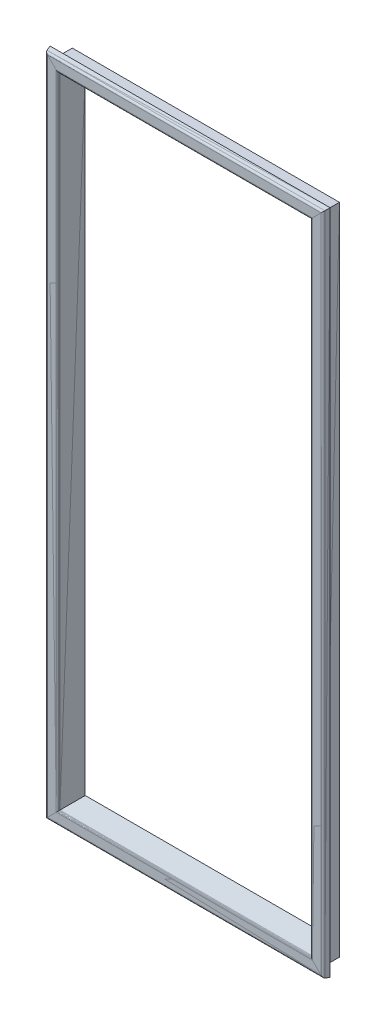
ISO-10303-21;
HEADER;
FILE_DESCRIPTION(('STEP AP214'),'2;1');
FILE_NAME('part.step','',(''),(''),'','','');
FILE_SCHEMA(('AUTOMOTIVE_DESIGN { 1 0 10303 214 1 1 1 1 }'));
ENDSEC;
DATA;
#1=APPLICATION_CONTEXT('core data for automotive mechanical design processes');
#2=APPLICATION_PROTOCOL_DEFINITION('international standard','automotive_design',2000,#1);
#3=PRODUCT_CONTEXT('',#1,'mechanical');
#4=PRODUCT('Part','Part','',(#3));
#5=PRODUCT_RELATED_PRODUCT_CATEGORY('part','',(#4));
#6=PRODUCT_DEFINITION_FORMATION('','',#4);
#7=PRODUCT_DEFINITION_CONTEXT('part definition',#1,'design');
#8=PRODUCT_DEFINITION('design','',#6,#7);
#9=PRODUCT_DEFINITION_SHAPE('','',#8);
#10=(LENGTH_UNIT() NAMED_UNIT(*) SI_UNIT(.MILLI.,.METRE.));
#11=(NAMED_UNIT(*) PLANE_ANGLE_UNIT() SI_UNIT($,.RADIAN.));
#12=(NAMED_UNIT(*) SI_UNIT($,.STERADIAN.) SOLID_ANGLE_UNIT());
#13=UNCERTAINTY_MEASURE_WITH_UNIT(LENGTH_MEASURE(1.E-05),#10,'distance_accuracy_value','');
#14=(GEOMETRIC_REPRESENTATION_CONTEXT(3) GLOBAL_UNCERTAINTY_ASSIGNED_CONTEXT((#13)) GLOBAL_UNIT_ASSIGNED_CONTEXT((#10,
#11,#12)) REPRESENTATION_CONTEXT('',''));
#15=CARTESIAN_POINT('',(0.,0.,0.));
#16=DIRECTION('',(0.,0.,1.));
#17=DIRECTION('',(1.,0.,0.));
#18=AXIS2_PLACEMENT_3D('',#15,#16,#17);
#19=CARTESIAN_POINT('',(151.290718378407,882.387960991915,-222.038456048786));
#20=DIRECTION('',(0.965925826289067,0.,0.258819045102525));
#21=DIRECTION('',(0.258819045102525,0.,-0.965925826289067));
#22=AXIS2_PLACEMENT_3D('',#19,#20,#21);
#23=PLANE('',#22);
#24=DIRECTION('',(0.,-1.,0.));
#25=VECTOR('',#24,1.);
#26=CARTESIAN_POINT('',(84.888912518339,948.789766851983,25.7764571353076));
#27=LINE('',#26,#25);
#28=CARTESIAN_POINT('',(84.888912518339,948.789766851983,25.7764571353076));
#29=VERTEX_POINT('',#28);
#30=CARTESIAN_POINT('',(84.888912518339,60.3147088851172,25.7764571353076));
#31=VERTEX_POINT('',#30);
#32=EDGE_CURVE('E77',#29,#31,#27,.T.);
#33=ORIENTED_EDGE('',*,*,#32,.T.);
#34=CARTESIAN_POINT('',(84.888912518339,60.3147088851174,25.7764571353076));
#35=DIRECTION('',(0.250562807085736,0.250562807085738,-0.935113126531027));
#36=VECTOR('',#35,1.);
#37=LINE('',#34,#36);
#38=CARTESIAN_POINT('',(92.3315917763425,67.7573881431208,-1.99999999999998));
#39=VERTEX_POINT('',#38);
#40=EDGE_CURVE('E191',#31,#39,#37,.T.);
#41=ORIENTED_EDGE('',*,*,#40,.T.);
#42=DIRECTION('',(0.,-1.,0.));
#43=VECTOR('',#42,1.);
#44=CARTESIAN_POINT('',(92.3315917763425,941.347087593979,-1.99999999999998));
#45=LINE('',#44,#43);
#46=CARTESIAN_POINT('',(92.3315917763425,941.347087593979,-1.99999999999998));
#47=VERTEX_POINT('',#46);
#48=EDGE_CURVE('E199',#47,#39,#45,.T.);
#49=ORIENTED_EDGE('',*,*,#48,.F.);
#50=DIRECTION('',(-0.250562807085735,0.250562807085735,0.935113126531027));
#51=VECTOR('',#50,1.);
#52=CARTESIAN_POINT('',(151.290718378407,882.387960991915,-222.038456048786));
#53=LINE('',#52,#51);
#54=EDGE_CURVE('E302',#47,#29,#53,.T.);
#55=ORIENTED_EDGE('',*,*,#54,.T.);
#56=EDGE_LOOP('',(#33,#41,#49,#55));
#57=FACE_BOUND('',#56,.T.);
#58=ADVANCED_FACE('F49',(#57),#23,.T.);
#59=CARTESIAN_POINT('',(74.3315917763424,959.347087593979,-1.99999999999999));
#60=DIRECTION('',(-1.,0.,0.));
#61=DIRECTION('',(0.,0.,1.));
#62=AXIS2_PLACEMENT_3D('',#59,#60,#61);
#63=PLANE('',#62);
#64=DIRECTION('',(0.,-1.,0.));
#65=VECTOR('',#64,1.);
#66=CARTESIAN_POINT('',(74.3315917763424,959.347087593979,-1.99999999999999));
#67=LINE('',#66,#65);
#68=CARTESIAN_POINT('',(74.3315917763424,959.347087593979,-1.99999999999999));
#69=VERTEX_POINT('',#68);
#70=CARTESIAN_POINT('',(74.3315917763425,49.7573881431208,-1.99999999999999));
#71=VERTEX_POINT('',#70);
#72=EDGE_CURVE('E172',#69,#71,#67,.T.);
#73=ORIENTED_EDGE('',*,*,#72,.T.);
#74=CARTESIAN_POINT('',(74.3315917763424,49.7573881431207,-1.99999999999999));
#75=DIRECTION('',(0.,0.,1.));
#76=VECTOR('',#75,1.);
#77=LINE('',#74,#76);
#78=CARTESIAN_POINT('',(74.3315917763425,49.7573881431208,20.));
#79=VERTEX_POINT('',#78);
#80=EDGE_CURVE('E183',#71,#79,#77,.T.);
#81=ORIENTED_EDGE('',*,*,#80,.T.);
#82=DIRECTION('',(0.,-1.,0.));
#83=VECTOR('',#82,1.);
#84=CARTESIAN_POINT('',(74.3315917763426,959.347087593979,20.));
#85=LINE('',#84,#83);
#86=CARTESIAN_POINT('',(74.3315917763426,959.347087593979,20.));
#87=VERTEX_POINT('',#86);
#88=EDGE_CURVE('E198',#87,#79,#85,.T.);
#89=ORIENTED_EDGE('',*,*,#88,.F.);
#90=DIRECTION('',(0.,0.,-1.));
#91=VECTOR('',#90,1.);
#92=CARTESIAN_POINT('',(74.3315917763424,959.347087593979,-1.99999999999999));
#93=LINE('',#92,#91);
#94=EDGE_CURVE('E196',#87,#69,#93,.T.);
#95=ORIENTED_EDGE('',*,*,#94,.T.);
#96=EDGE_LOOP('',(#73,#81,#89,#95));
#97=FACE_BOUND('',#96,.T.);
#98=ADVANCED_FACE('F194',(#97),#63,.T.);
#99=CARTESIAN_POINT('',(137.275278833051,896.403400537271,288.497495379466));
#100=DIRECTION('',(-0.965925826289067,0.,0.258819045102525));
#101=DIRECTION('',(0.258819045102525,0.,0.965925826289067));
#102=AXIS2_PLACEMENT_3D('',#99,#100,#101);
#103=PLANE('',#102);
#104=DIRECTION('',(0.,-1.,0.));
#105=VECTOR('',#104,1.);
#106=CARTESIAN_POINT('',(65.3315917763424,968.347087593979,20.));
#107=LINE('',#106,#105);
#108=CARTESIAN_POINT('',(65.3315917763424,968.347087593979,20.));
#109=VERTEX_POINT('',#108);
#110=CARTESIAN_POINT('',(65.3315917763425,40.7573881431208,20.));
#111=VERTEX_POINT('',#110);
#112=EDGE_CURVE('E201',#109,#111,#107,.T.);
#113=ORIENTED_EDGE('',*,*,#112,.T.);
#114=CARTESIAN_POINT('',(65.3315917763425,40.7573881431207,20.));
#115=DIRECTION('',(0.250562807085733,0.250562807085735,0.935113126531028));
#116=VECTOR('',#115,1.);
#117=LINE('',#114,#116);
#118=CARTESIAN_POINT('',(66.8793888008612,42.3051851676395,25.7764571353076));
#119=VERTEX_POINT('',#118);
#120=EDGE_CURVE('E61',#111,#119,#117,.T.);
#121=ORIENTED_EDGE('',*,*,#120,.T.);
#122=DIRECTION('',(0.,-1.,0.));
#123=VECTOR('',#122,1.);
#124=CARTESIAN_POINT('',(66.8793888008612,966.799290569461,25.7764571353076));
#125=LINE('',#124,#123);
#126=CARTESIAN_POINT('',(66.8793888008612,966.799290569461,25.7764571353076));
#127=VERTEX_POINT('',#126);
#128=EDGE_CURVE('E256',#127,#119,#125,.T.);
#129=ORIENTED_EDGE('',*,*,#128,.F.);
#130=DIRECTION('',(-0.250562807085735,0.250562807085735,-0.935113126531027));
#131=VECTOR('',#130,1.);
#132=CARTESIAN_POINT('',(137.275278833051,896.403400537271,288.497495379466));
#133=LINE('',#132,#131);
#134=EDGE_CURVE('E379',#127,#109,#133,.T.);
#135=ORIENTED_EDGE('',*,*,#134,.T.);
#136=EDGE_LOOP('',(#113,#121,#129,#135));
#137=FACE_BOUND('',#136,.T.);
#138=ADVANCED_FACE('F236',(#137),#103,.T.);
#139=CARTESIAN_POINT('',(69.7771662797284,963.901513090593,25.));
#140=DIRECTION('',(0.,-1.,0.));
#141=DIRECTION('',(0.,0.,-1.));
#142=AXIS2_PLACEMENT_3D('',#139,#140,#141);
#143=CYLINDRICAL_SURFACE('',#142,3.);
#144=ORIENTED_EDGE('',*,*,#128,.T.);
#145=CARTESIAN_POINT('',(66.8793888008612,42.3051851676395,25.7764571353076));
#146=CARTESIAN_POINT('',(66.8854051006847,42.3112020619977,25.7989108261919));
#147=CARTESIAN_POINT('',(66.8916661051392,42.3174641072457,25.8212327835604));
#148=CARTESIAN_POINT('',(66.904719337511,42.33051962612,25.865789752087));
#149=CARTESIAN_POINT('',(66.9115156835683,42.3373172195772,25.8880223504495));
#150=CARTESIAN_POINT('',(66.9256402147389,42.3514437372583,25.9323872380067));
#151=CARTESIAN_POINT('',(66.9329726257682,42.3587768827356,25.9545168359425));
#152=CARTESIAN_POINT('',(66.9481694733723,42.3739744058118,25.9986626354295));
#153=CARTESIAN_POINT('',(66.9560382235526,42.381843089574,26.020675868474));
#154=CARTESIAN_POINT('',(66.972307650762,42.3981116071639,26.0645756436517));
#155=CARTESIAN_POINT('',(66.9807127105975,42.4065158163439,26.0864589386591));
#156=CARTESIAN_POINT('',(66.9980543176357,42.423855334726,26.1300854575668));
#157=CARTESIAN_POINT('',(67.0069952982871,42.43279507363,26.1518251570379));
#158=CARTESIAN_POINT('',(67.0254080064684,42.4512055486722,26.1951510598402));
#159=CARTESIAN_POINT('',(67.0348842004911,42.4606807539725,26.2167334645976));
#160=CARTESIAN_POINT('',(67.0541310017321,42.4799271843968,26.25921207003));
#161=CARTESIAN_POINT('',(67.0638957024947,42.4896924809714,26.2801136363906));
#162=CARTESIAN_POINT('',(67.0839462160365,42.5097447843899,26.321781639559));
#163=CARTESIAN_POINT('',(67.0942369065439,42.5200366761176,26.3425433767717));
#164=CARTESIAN_POINT('',(67.1153402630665,42.5411421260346,26.3839176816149));
#165=CARTESIAN_POINT('',(67.1261577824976,42.5519605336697,26.4045252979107));
#166=CARTESIAN_POINT('',(67.1483152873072,42.5741190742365,26.4455771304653));
#167=CARTESIAN_POINT('',(67.1596600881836,42.5854640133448,26.4660161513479));
#168=CARTESIAN_POINT('',(67.1828722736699,42.6086756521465,26.506716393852));
#169=CARTESIAN_POINT('',(67.1947444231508,42.6205471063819,26.5269721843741));
#170=CARTESIAN_POINT('',(67.2190110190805,42.6448118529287,26.5672913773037));
#171=CARTESIAN_POINT('',(67.2314101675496,42.657209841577,26.5873491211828));
#172=CARTESIAN_POINT('',(67.2567301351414,42.6825276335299,26.627257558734));
#173=CARTESIAN_POINT('',(67.2696555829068,42.6954520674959,26.6471023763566));
#174=CARTESIAN_POINT('',(67.2955531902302,42.7213494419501,26.6858608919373));
#175=CARTESIAN_POINT('',(67.3085172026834,42.7343141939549,26.7047855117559));
#176=CARTESIAN_POINT('',(67.3349575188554,42.7607566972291,26.7424561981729));
#177=CARTESIAN_POINT('',(67.3484385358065,42.7742391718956,26.7611956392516));
#178=CARTESIAN_POINT('',(67.3759139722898,42.8017171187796,26.7984803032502));
#179=CARTESIAN_POINT('',(67.3899130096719,42.8157172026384,26.8170187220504));
#180=CARTESIAN_POINT('',(67.4184251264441,42.8442305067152,26.8538853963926));
#181=CARTESIAN_POINT('',(67.4329427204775,42.8587482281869,26.8722066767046));
#182=CARTESIAN_POINT('',(67.4624921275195,42.8882969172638,26.9086228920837));
#183=CARTESIAN_POINT('',(67.4775283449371,42.9033322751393,26.9267106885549));
#184=CARTESIAN_POINT('',(67.5081147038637,42.9339163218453,26.962643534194));
#185=CARTESIAN_POINT('',(67.5236691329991,42.9494692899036,26.9804812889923));
#186=CARTESIAN_POINT('',(67.5552910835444,42.9810887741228,27.0158973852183));
#187=CARTESIAN_POINT('',(67.5713627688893,42.9971594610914,27.0334682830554));
#188=CARTESIAN_POINT('',(67.6034537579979,43.0292498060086,27.0677314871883));
#189=CARTESIAN_POINT('',(67.6194674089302,43.0452637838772,27.0844344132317));
#190=CARTESIAN_POINT('',(67.6520082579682,43.0778051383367,27.1176052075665));
#191=CARTESIAN_POINT('',(67.6685395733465,43.0943366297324,27.134064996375));
#192=CARTESIAN_POINT('',(67.7021163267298,43.1279134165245,27.1667314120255));
#193=CARTESIAN_POINT('',(67.7191657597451,43.1449627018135,27.1829298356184));
#194=CARTESIAN_POINT('',(67.7450233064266,43.1708198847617,27.2069289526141));
#195=CARTESIAN_POINT('',(67.7537412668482,43.1795376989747,27.2149245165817));
#196=CARTESIAN_POINT('',(67.7710415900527,43.1968378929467,27.2306046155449));
#197=CARTESIAN_POINT('',(67.779622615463,43.2054189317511,27.2382921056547));
#198=CARTESIAN_POINT('',(67.8056701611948,43.2314666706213,27.2613592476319));
#199=CARTESIAN_POINT('',(67.8232239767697,43.2490208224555,27.2765421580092));
#200=CARTESIAN_POINT('',(67.8588483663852,43.2846455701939,27.3066446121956));
#201=CARTESIAN_POINT('',(67.8769226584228,43.3027198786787,27.3215553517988));
#202=CARTESIAN_POINT('',(67.913588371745,43.3393852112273,27.3510935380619));
#203=CARTESIAN_POINT('',(67.9321833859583,43.3579798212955,27.3657120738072));
#204=CARTESIAN_POINT('',(67.9692284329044,43.395024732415,27.3941377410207));
#205=CARTESIAN_POINT('',(67.9876746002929,43.4134711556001,27.4079549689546));
#206=CARTESIAN_POINT('',(68.0250924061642,43.4508894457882,27.4353201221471));
#207=CARTESIAN_POINT('',(68.0440675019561,43.4698647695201,27.4488585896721));
#208=CARTESIAN_POINT('',(68.0825438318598,43.5083410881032,27.475644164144));
#209=CARTESIAN_POINT('',(68.1020484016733,43.5278454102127,27.488881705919));
#210=CARTESIAN_POINT('',(68.1315694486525,43.5573660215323,27.5084163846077));
#211=CARTESIAN_POINT('',(68.141519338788,43.5673157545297,27.5149154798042));
#212=CARTESIAN_POINT('',(68.1611313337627,43.5869276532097,27.5275606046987));
#213=CARTESIAN_POINT('',(68.1707919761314,43.5965883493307,27.5337111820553));
#214=CARTESIAN_POINT('',(68.2001219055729,43.6259185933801,27.552150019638));
#215=CARTESIAN_POINT('',(68.2198545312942,43.6456516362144,27.564237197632));
#216=CARTESIAN_POINT('',(68.259863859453,43.6856613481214,27.5881164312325));
#217=CARTESIAN_POINT('',(68.2801436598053,43.7059411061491,27.5998981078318));
#218=CARTESIAN_POINT('',(68.321247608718,43.7470445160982,27.6231410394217));
#219=CARTESIAN_POINT('',(68.3420747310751,43.7678711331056,27.6345917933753));
#220=CARTESIAN_POINT('',(68.3832245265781,43.8090208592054,27.6565868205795));
#221=CARTESIAN_POINT('',(68.4035426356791,43.8293393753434,27.6671482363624));
#222=CARTESIAN_POINT('',(68.4447563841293,43.8705537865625,27.6879785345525));
#223=CARTESIAN_POINT('',(68.4656549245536,43.8914525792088,27.6982359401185));
#224=CARTESIAN_POINT('',(68.5080302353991,43.9338277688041,27.7184290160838));
#225=CARTESIAN_POINT('',(68.5295097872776,43.9553069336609,27.728353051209));
#226=CARTESIAN_POINT('',(68.5619919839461,43.9877885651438,27.7428990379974));
#227=CARTESIAN_POINT('',(68.5729487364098,43.9987451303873,27.74772690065));
#228=CARTESIAN_POINT('',(68.5943280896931,44.0201244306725,27.7569951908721));
#229=CARTESIAN_POINT('',(68.6047491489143,44.030545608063,27.76144276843));
#230=CARTESIAN_POINT('',(68.6364510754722,44.06224805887,27.774761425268));
#231=CARTESIAN_POINT('',(68.6577743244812,44.083571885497,27.7834311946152));
#232=CARTESIAN_POINT('',(68.7010590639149,44.1268570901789,27.8004548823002));
#233=CARTESIAN_POINT('',(68.7230231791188,44.1488210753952,27.8087954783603));
#234=CARTESIAN_POINT('',(68.7675897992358,44.1933868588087,27.8251251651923));
#235=CARTESIAN_POINT('',(68.7901947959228,44.215991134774,27.8331006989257));
#236=CARTESIAN_POINT('',(68.8342837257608,44.2600801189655,27.8480668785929));
#237=CARTESIAN_POINT('',(68.8557626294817,44.2815597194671,27.8550874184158));
#238=CARTESIAN_POINT('',(68.8994691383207,44.3252672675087,27.868830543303));
#239=CARTESIAN_POINT('',(68.9216992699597,44.3474977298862,27.8755370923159));
#240=CARTESIAN_POINT('',(68.9669090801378,44.3927072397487,27.8886075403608));
#241=CARTESIAN_POINT('',(68.9898911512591,44.4156886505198,27.894955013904));
#242=CARTESIAN_POINT('',(69.0246726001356,44.4504692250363,27.9041179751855));
#243=CARTESIAN_POINT('',(69.0364446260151,44.4622409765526,27.9071427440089));
#244=CARTESIAN_POINT('',(69.058928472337,44.4847248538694,27.9127746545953));
#245=CARTESIAN_POINT('',(69.0696387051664,44.495435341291,27.915394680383));
#246=CARTESIAN_POINT('',(69.1024766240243,44.5282742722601,27.9232364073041));
#247=CARTESIAN_POINT('',(69.1246279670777,44.5504266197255,27.9282603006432));
#248=CARTESIAN_POINT('',(69.1699031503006,44.5957025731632,27.9379907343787));
#249=CARTESIAN_POINT('',(69.193029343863,44.6188284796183,27.9426755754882));
#250=CARTESIAN_POINT('',(69.2402542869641,44.6660517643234,27.9516649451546));
#251=CARTESIAN_POINT('',(69.2643552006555,44.6901512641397,27.955946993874));
#252=CARTESIAN_POINT('',(69.3097348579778,44.735531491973,27.9634392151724));
#253=CARTESIAN_POINT('',(69.3310082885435,44.7568065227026,27.9667163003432));
#254=CARTESIAN_POINT('',(69.3750886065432,44.8008892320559,27.9730226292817));
#255=CARTESIAN_POINT('',(69.3978979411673,44.8236992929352,27.9760181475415));
#256=CARTESIAN_POINT('',(69.4450517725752,44.87085229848,27.9816606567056));
#257=CARTESIAN_POINT('',(69.4693985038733,44.8951973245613,27.984271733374));
#258=CARTESIAN_POINT('',(69.5065034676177,44.9323003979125,27.9877927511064));
#259=CARTESIAN_POINT('',(69.5192517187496,44.9450481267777,27.9889201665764));
#260=CARTESIAN_POINT('',(69.5427257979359,44.9685221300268,27.990844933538));
#261=CARTESIAN_POINT('',(69.553450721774,44.9792473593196,27.9916662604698));
#262=CARTESIAN_POINT('',(69.5942648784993,45.0200619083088,27.9945712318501));
#263=CARTESIAN_POINT('',(69.6243696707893,45.0501653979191,27.9962579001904));
#264=CARTESIAN_POINT('',(69.6686606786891,45.0944573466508,27.9980707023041));
#265=CARTESIAN_POINT('',(69.6828409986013,45.1086383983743,27.9985503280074));
#266=CARTESIAN_POINT('',(69.7237328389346,45.1495319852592,27.9996430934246));
#267=CARTESIAN_POINT('',(69.7504479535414,45.1762477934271,27.9999998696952));
#268=CARTESIAN_POINT('',(69.7771662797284,45.2029626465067,28.));
#269=B_SPLINE_CURVE_WITH_KNOTS('',3,(#145,#146,#147,#148,#149,#150,#151,#152,#153,#154,#155,
#156,#157,#158,#159,#160,#161,#162,#163,#164,#165,#166,#167,#168,#169,#170,#171,#172,#173,#174,
#175,#176,#177,#178,#179,#180,#181,#182,#183,#184,#185,#186,#187,#188,#189,#190,#191,#192,#193,
#194,#195,#196,#197,#198,#199,#200,#201,#202,#203,#204,#205,#206,#207,#208,#209,#210,#211,#212,
#213,#214,#215,#216,#217,#218,#219,#220,#221,#222,#223,#224,#225,#226,#227,#228,#229,#230,#231,
#232,#233,#234,#235,#236,#237,#238,#239,#240,#241,#242,#243,#244,#245,#246,#247,#248,#249,#250,
#251,#252,#253,#254,#255,#256,#257,#258,#259,#260,#261,#262,#263,#264,#265,#266,#267,#268),
.UNSPECIFIED.,.F.,.F.,(4,2,2,2,2,2,2,2,2,2,2,2,2,2,2,2,2,2,2,2,2,2,2,2,2,2,2,2,2,2,2,2,2,2,2,2,
2,2,2,2,2,2,2,2,2,2,2,2,2,2,2,2,2,2,2,2,2,2,2,2,2,4),(0.,0.0720319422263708,0.144685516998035,
0.217991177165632,0.291978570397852,0.366676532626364,0.442113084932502,0.51831543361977,
0.593460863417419,0.669516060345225,0.746503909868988,0.824446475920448,0.90336502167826,
0.983280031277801,1.06421123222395,1.14325155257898,1.22344420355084,1.30480485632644,
1.38734851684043,1.47108955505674,1.55604173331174,1.64221823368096,1.72663202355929,
1.8124011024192,1.89953576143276,1.94361891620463,1.98671453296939,2.07400738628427,
2.16277738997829,2.25303229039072,2.34158734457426,2.43175176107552,2.52353150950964,
2.57002948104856,2.61497753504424,2.70620658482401,2.79921792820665,2.89401578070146,
2.98585249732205,3.07970104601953,3.17556444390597,3.22425311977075,3.27043511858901,
3.36456256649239,3.46104412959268,3.55988170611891,3.65340832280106,3.74984098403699,
3.84918085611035,3.89994183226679,3.94605641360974,4.04123488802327,4.14034727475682,
4.24339411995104,4.33418340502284,4.431368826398,4.53495056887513,4.58914066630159,
4.63470971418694,4.76251899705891,4.82269898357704,4.93604297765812),.UNSPECIFIED.);
#270=CARTESIAN_POINT('',(69.7771662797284,45.2029626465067,28.));
#271=VERTEX_POINT('',#270);
#272=EDGE_CURVE('E13',#119,#271,#269,.T.);
#273=ORIENTED_EDGE('',*,*,#272,.T.);
#274=DIRECTION('',(0.,-1.,0.));
#275=VECTOR('',#274,1.);
#276=CARTESIAN_POINT('',(69.7771662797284,963.901513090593,28.));
#277=LINE('',#276,#275);
#278=CARTESIAN_POINT('',(69.7771662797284,963.901513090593,28.));
#279=VERTEX_POINT('',#278);
#280=EDGE_CURVE('E262',#279,#271,#277,.T.);
#281=ORIENTED_EDGE('',*,*,#280,.F.);
#282=CARTESIAN_POINT('',(69.7771662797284,963.901513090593,25.));
#283=DIRECTION('',(-0.707106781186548,-0.707106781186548,0.));
#284=DIRECTION('',(-0.707106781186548,0.707106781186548,0.));
#285=AXIS2_PLACEMENT_3D('',#282,#283,#284);
#286=ELLIPSE('',#285,4.24264068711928,3.);
#287=EDGE_CURVE('E306',#279,#127,#286,.T.);
#288=ORIENTED_EDGE('',*,*,#287,.T.);
#289=EDGE_LOOP('',(#144,#273,#281,#288));
#290=FACE_BOUND('',#289,.T.);
#291=ADVANCED_FACE('F239',(#290),#143,.T.);
#292=CARTESIAN_POINT('',(81.9911350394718,951.68754433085,25.));
#293=DIRECTION('',(0.,-1.,0.));
#294=DIRECTION('',(0.,0.,-1.));
#295=AXIS2_PLACEMENT_3D('',#292,#293,#294);
#296=CYLINDRICAL_SURFACE('',#295,3.);
#297=DIRECTION('',(0.,-1.,0.));
#298=VECTOR('',#297,1.);
#299=CARTESIAN_POINT('',(81.9911350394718,951.68754433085,28.));
#300=LINE('',#299,#298);
#301=CARTESIAN_POINT('',(81.9911350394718,951.68754433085,28.));
#302=VERTEX_POINT('',#301);
#303=CARTESIAN_POINT('',(81.9911350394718,57.41693140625,28.));
#304=VERTEX_POINT('',#303);
#305=EDGE_CURVE('E267',#302,#304,#300,.T.);
#306=ORIENTED_EDGE('',*,*,#305,.T.);
#307=CARTESIAN_POINT('',(81.9911350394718,57.41693140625,28.));
#308=CARTESIAN_POINT('',(82.017845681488,57.4436385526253,27.9999998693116));
#309=CARTESIAN_POINT('',(82.0445530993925,57.4703466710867,27.9996432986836));
#310=CARTESIAN_POINT('',(82.0854449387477,57.5112402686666,27.9985508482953));
#311=CARTESIAN_POINT('',(82.099632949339,57.525429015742,27.9980710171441));
#312=CARTESIAN_POINT('',(82.1439224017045,57.5697194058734,27.9962582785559));
#313=CARTESIAN_POINT('',(82.1740179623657,57.5998136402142,27.9945722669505));
#314=CARTESIAN_POINT('',(82.2148321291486,57.6406282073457,27.9916676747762));
#315=CARTESIAN_POINT('',(82.2255662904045,57.6513626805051,27.9908456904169));
#316=CARTESIAN_POINT('',(82.2490440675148,57.6748404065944,27.9889206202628));
#317=CARTESIAN_POINT('',(82.2617867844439,57.687582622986,27.9877937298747));
#318=CARTESIAN_POINT('',(82.2988806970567,57.7246746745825,27.9842739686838));
#319=CARTESIAN_POINT('',(82.323221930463,57.7490141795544,27.9816636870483));
#320=CARTESIAN_POINT('',(82.3703721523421,57.7961635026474,27.976022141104));
#321=CARTESIAN_POINT('',(82.3931833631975,57.818975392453,27.9730266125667));
#322=CARTESIAN_POINT('',(82.437274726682,57.8630691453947,27.9667191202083));
#323=CARTESIAN_POINT('',(82.4585573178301,57.8843533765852,27.9634407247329));
#324=CARTESIAN_POINT('',(82.5039367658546,57.9297334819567,27.9559485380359));
#325=CARTESIAN_POINT('',(82.5280283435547,57.9538236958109,27.9516682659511));
#326=CARTESIAN_POINT('',(82.5752421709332,58.0010358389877,27.9426814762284));
#327=CARTESIAN_POINT('',(82.598366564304,58.0241598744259,27.9379972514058));
#328=CARTESIAN_POINT('',(82.6436455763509,58.0694395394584,27.9282665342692));
#329=CARTESIAN_POINT('',(82.6658025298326,58.0915974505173,27.923241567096));
#330=CARTESIAN_POINT('',(82.698651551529,58.1244475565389,27.9153973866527));
#331=CARTESIAN_POINT('',(82.7093673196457,58.1351636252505,27.9127760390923));
#332=CARTESIAN_POINT('',(82.7318511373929,58.1576475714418,27.9071441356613));
#333=CARTESIAN_POINT('',(82.743617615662,58.169413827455,27.9041208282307));
#334=CARTESIAN_POINT('',(82.7783880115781,58.2041834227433,27.8949609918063));
#335=CARTESIAN_POINT('',(82.8013646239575,58.2271593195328,27.8886152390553));
#336=CARTESIAN_POINT('',(82.8465709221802,58.2723651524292,27.8755463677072));
#337=CARTESIAN_POINT('',(82.8688029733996,58.2945974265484,27.8688394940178));
#338=CARTESIAN_POINT('',(82.912520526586,58.3383160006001,27.8550933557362));
#339=CARTESIAN_POINT('',(82.9340085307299,58.3598047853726,27.8480699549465));
#340=CARTESIAN_POINT('',(82.9780974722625,58.4038939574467,27.8331037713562));
#341=CARTESIAN_POINT('',(83.0006934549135,58.4264893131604,27.825131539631));
#342=CARTESIAN_POINT('',(83.0452494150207,58.4710443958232,27.8088062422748));
#343=CARTESIAN_POINT('',(83.0672118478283,58.493006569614,27.8004665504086));
#344=CARTESIAN_POINT('',(83.1105003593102,58.5362953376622,27.7834419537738));
#345=CARTESIAN_POINT('',(83.1318290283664,58.5576245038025,27.7747701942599));
#346=CARTESIAN_POINT('',(83.1635415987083,58.5893377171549,27.7614472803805));
#347=CARTESIAN_POINT('',(83.1739679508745,58.5997642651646,27.7569974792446));
#348=CARTESIAN_POINT('',(83.195347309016,58.6211437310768,27.747729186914));
#349=CARTESIAN_POINT('',(83.2062988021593,58.6320951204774,27.7429036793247));
#350=CARTESIAN_POINT('',(83.2387705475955,58.6645664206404,27.7283625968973));
#351=CARTESIAN_POINT('',(83.2602449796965,58.6860403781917,27.7184411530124));
#352=CARTESIAN_POINT('',(83.3026170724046,58.7284120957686,27.6982502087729));
#353=CARTESIAN_POINT('',(83.3235174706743,58.7493125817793,27.6879921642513));
#354=CARTESIAN_POINT('',(83.3647416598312,58.7905374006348,27.6671570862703));
#355=CARTESIAN_POINT('',(83.3850683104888,58.8108645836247,27.6565913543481));
#356=CARTESIAN_POINT('',(83.4262181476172,58.8520146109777,27.634596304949));
#357=CARTESIAN_POINT('',(83.447036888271,58.8728329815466,27.6231502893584));
#358=CARTESIAN_POINT('',(83.4881310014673,58.9139265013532,27.599913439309));
#359=CARTESIAN_POINT('',(83.5084092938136,58.9342045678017,27.5881329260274));
#360=CARTESIAN_POINT('',(83.5484222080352,58.9742175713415,27.5642521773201));
#361=CARTESIAN_POINT('',(83.568159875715,58.9939555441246,27.5521621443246));
#362=CARTESIAN_POINT('',(83.5974996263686,59.0232957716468,27.5337173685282));
#363=CARTESIAN_POINT('',(83.6071651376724,59.0329614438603,27.5275637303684));
#364=CARTESIAN_POINT('',(83.6267771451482,59.0525735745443,27.5149185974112));
#365=CARTESIAN_POINT('',(83.6367222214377,59.0625186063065,27.5084226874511));
#366=CARTESIAN_POINT('',(83.6662337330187,59.0920298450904,27.488894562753));
#367=CARTESIAN_POINT('',(83.6857336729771,59.1115294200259,27.4756604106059));
#368=CARTESIAN_POINT('',(83.7242071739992,59.1500025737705,27.4488774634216));
#369=CARTESIAN_POINT('',(83.7431840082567,59.1689794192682,27.4353380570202));
#370=CARTESIAN_POINT('',(83.7806113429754,59.2064071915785,27.4079664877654));
#371=CARTESIAN_POINT('',(83.7990652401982,59.2248615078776,27.3941436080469));
#372=CARTESIAN_POINT('',(83.8361103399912,59.2619068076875,27.365717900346));
#373=CARTESIAN_POINT('',(83.8546978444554,59.2804940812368,27.3511054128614));
#374=CARTESIAN_POINT('',(83.8913548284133,59.3171506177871,27.3215748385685));
#375=CARTESIAN_POINT('',(83.9094278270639,59.3352233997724,27.3066654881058));
#376=CARTESIAN_POINT('',(83.9450555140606,59.3708510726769,27.2765609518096));
#377=CARTESIAN_POINT('',(83.9626138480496,59.3884096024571,27.2613743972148));
#378=CARTESIAN_POINT('',(83.988670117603,59.4144662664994,27.2382997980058));
#379=CARTESIAN_POINT('',(83.9972554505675,59.4230517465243,27.2306084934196));
#380=CARTESIAN_POINT('',(84.0145557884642,59.4403522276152,27.2149283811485));
#381=CARTESIAN_POINT('',(84.0232695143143,59.4490659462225,27.2069367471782));
#382=CARTESIAN_POINT('',(84.0491187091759,59.4749149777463,27.1829456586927));
#383=CARTESIAN_POINT('',(84.0661641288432,59.4919601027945,27.1667513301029));
#384=CARTESIAN_POINT('',(84.0997385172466,59.5255341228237,27.1340879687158));
#385=CARTESIAN_POINT('',(84.1162713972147,59.542066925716,27.1176269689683));
#386=CARTESIAN_POINT('',(84.1488206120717,59.5746165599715,27.084448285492));
#387=CARTESIAN_POINT('',(84.1648409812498,59.5906374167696,27.0677385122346));
#388=CARTESIAN_POINT('',(84.1969346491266,59.6227309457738,27.0334724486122));
#389=CARTESIAN_POINT('',(84.2130024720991,59.6387981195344,27.0159058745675));
#390=CARTESIAN_POINT('',(84.244618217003,59.6704116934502,26.9804971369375));
#391=CARTESIAN_POINT('',(84.260170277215,59.6859622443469,26.9626623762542));
#392=CARTESIAN_POINT('',(84.2907532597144,59.7165426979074,26.9267341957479));
#393=CARTESIAN_POINT('',(84.3057884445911,59.7315768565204,26.9086480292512));
#394=CARTESIAN_POINT('',(84.3353370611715,59.7611243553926,26.8722336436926));
#395=CARTESIAN_POINT('',(84.3498548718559,59.7756420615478,26.8539125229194));
#396=CARTESIAN_POINT('',(84.3783685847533,59.8041565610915,26.8170446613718));
#397=CARTESIAN_POINT('',(84.3923689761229,59.8181578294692,26.7985048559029));
#398=CARTESIAN_POINT('',(84.4198481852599,59.8456393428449,26.7612158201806));
#399=CARTESIAN_POINT('',(84.4333315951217,59.8591241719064,26.7424733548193));
#400=CARTESIAN_POINT('',(84.4597776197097,59.8855726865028,26.7047949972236));
#401=CARTESIAN_POINT('',(84.4727449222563,59.8985410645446,26.6858656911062));
#402=CARTESIAN_POINT('',(84.4986425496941,59.9244391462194,26.6471071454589));
#403=CARTESIAN_POINT('',(84.5115648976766,59.9373608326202,26.6272672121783));
#404=CARTESIAN_POINT('',(84.5368799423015,59.962674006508,26.5873670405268));
#405=CARTESIAN_POINT('',(84.5492772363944,59.9750700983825,26.5673126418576));
#406=CARTESIAN_POINT('',(84.5735412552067,59.9993320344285,26.5269986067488));
#407=CARTESIAN_POINT('',(84.5854126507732,60.0112025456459,26.5067445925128));
#408=CARTESIAN_POINT('',(84.6086243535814,60.0344132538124,26.4660462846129));
#409=CARTESIAN_POINT('',(84.6199693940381,60.0457581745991,26.445607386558));
#410=CARTESIAN_POINT('',(84.6421282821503,60.0679176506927,26.4045541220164));
#411=CARTESIAN_POINT('',(84.6529469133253,60.0787369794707,26.3839449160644));
#412=CARTESIAN_POINT('',(84.6740532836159,60.0998452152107,26.3425656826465));
#413=CARTESIAN_POINT('',(84.6843458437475,60.1101389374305,26.3218005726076));
#414=CARTESIAN_POINT('',(84.7044007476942,60.1301959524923,26.2801240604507));
#415=CARTESIAN_POINT('',(84.714167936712,60.1399640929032,26.2592173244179));
#416=CARTESIAN_POINT('',(84.7334159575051,60.1592125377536,26.2167360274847));
#417=CARTESIAN_POINT('',(84.7428910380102,60.1686870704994,26.195156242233));
#418=CARTESIAN_POINT('',(84.7613020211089,60.187096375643,26.1518347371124));
#419=CARTESIAN_POINT('',(84.7702423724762,60.1960356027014,26.1300968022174));
#420=CARTESIAN_POINT('',(84.7875831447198,60.2133743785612,26.0864729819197));
#421=CARTESIAN_POINT('',(84.7959879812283,60.2217783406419,26.0645906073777));
#422=CARTESIAN_POINT('',(84.8122573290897,60.2380466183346,26.0206918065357));
#423=CARTESIAN_POINT('',(84.8201262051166,60.2459152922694,25.9986786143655));
#424=CARTESIAN_POINT('',(84.8353236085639,60.2611130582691,25.9545320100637));
#425=CARTESIAN_POINT('',(84.8426564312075,60.2684464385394,25.932401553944));
#426=CARTESIAN_POINT('',(84.856782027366,60.2825736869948,25.8880340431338));
#427=CARTESIAN_POINT('',(84.8635790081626,60.2893717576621,25.8657996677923));
#428=CARTESIAN_POINT('',(84.8766336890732,60.3024284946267,25.8212382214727));
#429=CARTESIAN_POINT('',(84.8828954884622,60.3086912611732,25.7989135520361));
#430=CARTESIAN_POINT('',(84.888912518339,60.3147088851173,25.7764571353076));
#431=B_SPLINE_CURVE_WITH_KNOTS('',3,(#307,#308,#309,#310,#311,#312,#313,#314,#315,#316,#317,
#318,#319,#320,#321,#322,#323,#324,#325,#326,#327,#328,#329,#330,#331,#332,#333,#334,#335,#336,
#337,#338,#339,#340,#341,#342,#343,#344,#345,#346,#347,#348,#349,#350,#351,#352,#353,#354,#355,
#356,#357,#358,#359,#360,#361,#362,#363,#364,#365,#366,#367,#368,#369,#370,#371,#372,#373,#374,
#375,#376,#377,#378,#379,#380,#381,#382,#383,#384,#385,#386,#387,#388,#389,#390,#391,#392,#393,
#394,#395,#396,#397,#398,#399,#400,#401,#402,#403,#404,#405,#406,#407,#408,#409,#410,#411,#412,
#413,#414,#415,#416,#417,#418,#419,#420,#421,#422,#423,#424,#425,#426,#427,#428,#429,#430),
.UNSPECIFIED.,.F.,.F.,(4,2,2,2,2,2,2,2,2,2,2,2,2,2,2,2,2,2,2,2,2,2,2,2,2,2,2,2,2,2,2,2,2,2,2,2,
2,2,2,2,2,2,2,2,2,2,2,2,2,2,2,2,2,2,2,2,2,2,2,2,2,4),(0.,0.113311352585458,0.173523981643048,
0.301294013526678,0.346902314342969,0.401068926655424,0.504627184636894,0.601820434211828,
0.692648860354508,0.795655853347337,0.8947602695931,0.989962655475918,1.03610114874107,
1.08683829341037,1.18615433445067,1.28259493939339,1.37616127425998,1.47495954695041,
1.5714332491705,1.66558427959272,1.71178986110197,1.76045530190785,1.85629546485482,
1.95015175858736,2.04202719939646,2.1367870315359,2.22979077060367,2.32104263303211,
2.36601349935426,2.41248914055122,2.50424655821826,2.59441841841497,2.68301068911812,
2.77322925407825,2.86199199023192,2.94930664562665,2.99242406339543,3.03648597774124,
3.123599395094,3.20937555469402,3.29382474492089,3.37998093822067,3.46491957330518,
3.54865383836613,3.63119749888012,3.71256492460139,3.79277111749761,3.87183174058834,
3.95274376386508,4.03264598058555,4.11155812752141,4.18950069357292,4.26649494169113,
4.34256293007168,4.41772753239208,4.49392120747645,4.56935196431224,4.64404702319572,
4.71803441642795,4.7913429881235,4.8640023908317,4.93604307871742),.UNSPECIFIED.);
#432=EDGE_CURVE('E68',#304,#31,#431,.T.);
#433=ORIENTED_EDGE('',*,*,#432,.T.);
#434=ORIENTED_EDGE('',*,*,#32,.F.);
#435=CARTESIAN_POINT('',(81.9911350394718,951.68754433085,25.));
#436=DIRECTION('',(-0.707106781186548,-0.707106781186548,0.));
#437=DIRECTION('',(-0.707106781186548,0.707106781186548,0.));
#438=AXIS2_PLACEMENT_3D('',#435,#436,#437);
#439=ELLIPSE('',#438,4.24264068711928,3.);
#440=EDGE_CURVE('E204',#29,#302,#439,.T.);
#441=ORIENTED_EDGE('',*,*,#440,.T.);
#442=EDGE_LOOP('',(#306,#433,#434,#441));
#443=FACE_BOUND('',#442,.T.);
#444=ADVANCED_FACE('F51',(#443),#296,.T.);
#445=CARTESIAN_POINT('',(384.661961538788,898.020870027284,-163.695645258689));
#446=DIRECTION('',(0.,0.965925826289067,-0.258819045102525));
#447=DIRECTION('',(0.,0.258819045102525,0.965925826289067));
#448=AXIS2_PLACEMENT_3D('',#445,#446,#447);
#449=PLANE('',#448);
#450=ORIENTED_EDGE('',*,*,#54,.F.);
#451=DIRECTION('',(-1.,0.,0.));
#452=VECTOR('',#451,1.);
#453=CARTESIAN_POINT('',(427.988179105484,941.347087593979,-1.99999999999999));
#454=LINE('',#453,#452);
#455=CARTESIAN_POINT('',(427.988179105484,941.347087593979,-1.99999999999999));
#456=VERTEX_POINT('',#455);
#457=EDGE_CURVE('E324',#456,#47,#454,.T.);
#458=ORIENTED_EDGE('',*,*,#457,.F.);
#459=DIRECTION('',(-0.250562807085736,-0.250562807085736,-0.935113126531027));
#460=VECTOR('',#459,1.);
#461=CARTESIAN_POINT('',(384.661961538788,898.020870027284,-163.695645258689));
#462=LINE('',#461,#460);
#463=CARTESIAN_POINT('',(435.430858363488,948.789766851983,25.7764571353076));
#464=VERTEX_POINT('',#463);
#465=EDGE_CURVE('E328',#464,#456,#462,.T.);
#466=ORIENTED_EDGE('',*,*,#465,.F.);
#467=DIRECTION('',(-1.,0.,0.));
#468=VECTOR('',#467,1.);
#469=CARTESIAN_POINT('',(435.430858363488,948.789766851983,25.7764571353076));
#470=LINE('',#469,#468);
#471=EDGE_CURVE('E303',#464,#29,#470,.T.);
#472=ORIENTED_EDGE('',*,*,#471,.T.);
#473=EDGE_LOOP('',(#450,#458,#466,#472));
#474=FACE_BOUND('',#473,.T.);
#475=ADVANCED_FACE('F490',(#474),#449,.F.);
#476=CARTESIAN_POINT('',(445.988179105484,959.347087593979,-1.99999999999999));
#477=DIRECTION('',(0.,-1.,0.));
#478=DIRECTION('',(0.,0.,-1.));
#479=AXIS2_PLACEMENT_3D('',#476,#477,#478);
#480=PLANE('',#479);
#481=ORIENTED_EDGE('',*,*,#94,.F.);
#482=DIRECTION('',(-1.,0.,0.));
#483=VECTOR('',#482,1.);
#484=CARTESIAN_POINT('',(445.988179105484,959.347087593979,20.));
#485=LINE('',#484,#483);
#486=CARTESIAN_POINT('',(445.988179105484,959.347087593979,20.));
#487=VERTEX_POINT('',#486);
#488=EDGE_CURVE('E319',#487,#87,#485,.T.);
#489=ORIENTED_EDGE('',*,*,#488,.F.);
#490=DIRECTION('',(0.,0.,1.));
#491=VECTOR('',#490,1.);
#492=CARTESIAN_POINT('',(445.988179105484,959.347087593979,-1.99999999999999));
#493=LINE('',#492,#491);
#494=CARTESIAN_POINT('',(445.988179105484,959.347087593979,-1.99999999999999));
#495=VERTEX_POINT('',#494);
#496=EDGE_CURVE('E331',#495,#487,#493,.T.);
#497=ORIENTED_EDGE('',*,*,#496,.F.);
#498=DIRECTION('',(-1.,0.,0.));
#499=VECTOR('',#498,1.);
#500=CARTESIAN_POINT('',(445.988179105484,959.347087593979,-1.99999999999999));
#501=LINE('',#500,#499);
#502=EDGE_CURVE('E322',#495,#69,#501,.T.);
#503=ORIENTED_EDGE('',*,*,#502,.T.);
#504=EDGE_LOOP('',(#481,#489,#497,#503));
#505=FACE_BOUND('',#504,.T.);
#506=ADVANCED_FACE('F510',(#505),#480,.F.);
#507=CARTESIAN_POINT('',(400.689927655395,914.048836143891,222.643833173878));
#508=DIRECTION('',(0.,-0.965925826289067,-0.258819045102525));
#509=DIRECTION('',(0.,0.258819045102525,-0.965925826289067));
#510=AXIS2_PLACEMENT_3D('',#507,#508,#509);
#511=PLANE('',#510);
#512=ORIENTED_EDGE('',*,*,#134,.F.);
#513=DIRECTION('',(-1.,0.,0.));
#514=VECTOR('',#513,1.);
#515=CARTESIAN_POINT('',(453.440382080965,966.799290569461,25.7764571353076));
#516=LINE('',#515,#514);
#517=CARTESIAN_POINT('',(453.440382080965,966.799290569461,25.7764571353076));
#518=VERTEX_POINT('',#517);
#519=EDGE_CURVE('E313',#518,#127,#516,.T.);
#520=ORIENTED_EDGE('',*,*,#519,.F.);
#521=DIRECTION('',(-0.250562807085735,-0.250562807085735,0.935113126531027));
#522=VECTOR('',#521,1.);
#523=CARTESIAN_POINT('',(400.689927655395,914.048836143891,222.643833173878));
#524=LINE('',#523,#522);
#525=CARTESIAN_POINT('',(454.988179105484,968.347087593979,20.));
#526=VERTEX_POINT('',#525);
#527=EDGE_CURVE('E369',#526,#518,#524,.T.);
#528=ORIENTED_EDGE('',*,*,#527,.F.);
#529=DIRECTION('',(-1.,0.,0.));
#530=VECTOR('',#529,1.);
#531=CARTESIAN_POINT('',(454.988179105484,968.347087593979,20.));
#532=LINE('',#531,#530);
#533=EDGE_CURVE('E316',#526,#109,#532,.T.);
#534=ORIENTED_EDGE('',*,*,#533,.T.);
#535=EDGE_LOOP('',(#512,#520,#528,#534));
#536=FACE_BOUND('',#535,.T.);
#537=ADVANCED_FACE('F385',(#536),#511,.F.);
#538=CARTESIAN_POINT('',(450.542604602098,963.901513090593,25.));
#539=DIRECTION('',(-1.,0.,0.));
#540=DIRECTION('',(0.,0.,1.));
#541=AXIS2_PLACEMENT_3D('',#538,#539,#540);
#542=CYLINDRICAL_SURFACE('',#541,3.);
#543=ORIENTED_EDGE('',*,*,#287,.F.);
#544=DIRECTION('',(-1.,0.,0.));
#545=VECTOR('',#544,1.);
#546=CARTESIAN_POINT('',(450.542604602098,963.901513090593,28.));
#547=LINE('',#546,#545);
#548=CARTESIAN_POINT('',(450.542604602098,963.901513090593,28.));
#549=VERTEX_POINT('',#548);
#550=EDGE_CURVE('E310',#549,#279,#547,.T.);
#551=ORIENTED_EDGE('',*,*,#550,.F.);
#552=CARTESIAN_POINT('',(450.542604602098,963.901513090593,25.));
#553=DIRECTION('',(-0.707106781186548,0.707106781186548,0.));
#554=DIRECTION('',(0.707106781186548,0.707106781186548,0.));
#555=AXIS2_PLACEMENT_3D('',#552,#553,#554);
#556=ELLIPSE('',#555,4.24264068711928,3.);
#557=EDGE_CURVE('E372',#518,#549,#556,.F.);
#558=ORIENTED_EDGE('',*,*,#557,.F.);
#559=ORIENTED_EDGE('',*,*,#519,.T.);
#560=EDGE_LOOP('',(#543,#551,#558,#559));
#561=FACE_BOUND('',#560,.T.);
#562=ADVANCED_FACE('F388',(#561),#542,.T.);
#563=CARTESIAN_POINT('',(438.328635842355,951.68754433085,25.));
#564=DIRECTION('',(-1.,0.,0.));
#565=DIRECTION('',(0.,0.,1.));
#566=AXIS2_PLACEMENT_3D('',#563,#564,#565);
#567=CYLINDRICAL_SURFACE('',#566,3.);
#568=ORIENTED_EDGE('',*,*,#440,.F.);
#569=ORIENTED_EDGE('',*,*,#471,.F.);
#570=CARTESIAN_POINT('',(438.328635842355,951.68754433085,25.));
#571=DIRECTION('',(-0.707106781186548,0.707106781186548,0.));
#572=DIRECTION('',(0.707106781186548,0.707106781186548,0.));
#573=AXIS2_PLACEMENT_3D('',#570,#571,#572);
#574=ELLIPSE('',#573,4.24264068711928,3.);
#575=CARTESIAN_POINT('',(438.328635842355,951.68754433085,28.));
#576=VERTEX_POINT('',#575);
#577=EDGE_CURVE('E327',#576,#464,#574,.F.);
#578=ORIENTED_EDGE('',*,*,#577,.F.);
#579=DIRECTION('',(-1.,0.,0.));
#580=VECTOR('',#579,1.);
#581=CARTESIAN_POINT('',(438.328635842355,951.68754433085,28.));
#582=LINE('',#581,#580);
#583=EDGE_CURVE('E307',#576,#302,#582,.T.);
#584=ORIENTED_EDGE('',*,*,#583,.T.);
#585=EDGE_LOOP('',(#568,#569,#578,#584));
#586=FACE_BOUND('',#585,.T.);
#587=ADVANCED_FACE('F231',(#586),#567,.T.);
#588=CARTESIAN_POINT('',(445.988179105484,49.7573881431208,-1.99999999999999));
#589=DIRECTION('',(1.,0.,0.));
#590=DIRECTION('',(0.,0.,-1.));
#591=AXIS2_PLACEMENT_3D('',#588,#589,#590);
#592=PLANE('',#591);
#593=DIRECTION('',(0.,1.,0.));
#594=VECTOR('',#593,1.);
#595=CARTESIAN_POINT('',(445.988179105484,49.7573881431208,-1.99999999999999));
#596=LINE('',#595,#594);
#597=CARTESIAN_POINT('',(445.988179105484,49.7573881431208,-1.99999999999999));
#598=VERTEX_POINT('',#597);
#599=EDGE_CURVE('E175',#598,#495,#596,.T.);
#600=ORIENTED_EDGE('',*,*,#599,.T.);
#601=ORIENTED_EDGE('',*,*,#496,.T.);
#602=DIRECTION('',(0.,1.,0.));
#603=VECTOR('',#602,1.);
#604=CARTESIAN_POINT('',(445.988179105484,49.7573881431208,20.));
#605=LINE('',#604,#603);
#606=CARTESIAN_POINT('',(445.988179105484,49.7573881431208,20.));
#607=VERTEX_POINT('',#606);
#608=EDGE_CURVE('E350',#607,#487,#605,.T.);
#609=ORIENTED_EDGE('',*,*,#608,.F.);
#610=DIRECTION('',(0.,0.,-1.));
#611=VECTOR('',#610,1.);
#612=CARTESIAN_POINT('',(445.988179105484,49.7573881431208,-1.99999999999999));
#613=LINE('',#612,#611);
#614=EDGE_CURVE('E354',#607,#598,#613,.T.);
#615=ORIENTED_EDGE('',*,*,#614,.T.);
#616=EDGE_LOOP('',(#600,#601,#609,#615));
#617=FACE_BOUND('',#616,.T.);
#618=ADVANCED_FACE('F471',(#617),#592,.T.);
#619=CARTESIAN_POINT('',(459.490993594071,36.2545736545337,3.19526755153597));
#620=DIRECTION('',(0.965925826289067,0.,0.258819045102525));
#621=DIRECTION('',(0.258819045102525,0.,-0.965925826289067));
#622=AXIS2_PLACEMENT_3D('',#619,#620,#621);
#623=PLANE('',#622);
#624=DIRECTION('',(0.,1.,0.));
#625=VECTOR('',#624,1.);
#626=CARTESIAN_POINT('',(454.988179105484,40.7573881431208,20.));
#627=LINE('',#626,#625);
#628=CARTESIAN_POINT('',(454.988179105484,40.7573881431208,20.));
#629=VERTEX_POINT('',#628);
#630=EDGE_CURVE('E347',#629,#526,#627,.T.);
#631=ORIENTED_EDGE('',*,*,#630,.T.);
#632=ORIENTED_EDGE('',*,*,#527,.T.);
#633=DIRECTION('',(0.,1.,0.));
#634=VECTOR('',#633,1.);
#635=CARTESIAN_POINT('',(453.440382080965,42.3051851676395,25.7764571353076));
#636=LINE('',#635,#634);
#637=CARTESIAN_POINT('',(453.440382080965,42.3051851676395,25.7764571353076));
#638=VERTEX_POINT('',#637);
#639=EDGE_CURVE('E344',#638,#518,#636,.T.);
#640=ORIENTED_EDGE('',*,*,#639,.F.);
#641=DIRECTION('',(0.250562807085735,-0.250562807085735,-0.935113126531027));
#642=VECTOR('',#641,1.);
#643=CARTESIAN_POINT('',(459.490993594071,36.2545736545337,3.19526755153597));
#644=LINE('',#643,#642);
#645=EDGE_CURVE('E179',#638,#629,#644,.T.);
#646=ORIENTED_EDGE('',*,*,#645,.T.);
#647=EDGE_LOOP('',(#631,#632,#640,#646));
#648=FACE_BOUND('',#647,.T.);
#649=ADVANCED_FACE('F394',(#648),#623,.T.);
#650=CARTESIAN_POINT('',(450.542604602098,45.2029626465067,25.));
#651=DIRECTION('',(0.,1.,0.));
#652=DIRECTION('',(0.,0.,1.));
#653=AXIS2_PLACEMENT_3D('',#650,#651,#652);
#654=CYLINDRICAL_SURFACE('',#653,3.);
#655=ORIENTED_EDGE('',*,*,#639,.T.);
#656=ORIENTED_EDGE('',*,*,#557,.T.);
#657=DIRECTION('',(0.,1.,0.));
#658=VECTOR('',#657,1.);
#659=CARTESIAN_POINT('',(450.542604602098,45.2029626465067,28.));
#660=LINE('',#659,#658);
#661=CARTESIAN_POINT('',(450.542604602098,45.2029626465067,28.));
#662=VERTEX_POINT('',#661);
#663=EDGE_CURVE('E341',#662,#549,#660,.T.);
#664=ORIENTED_EDGE('',*,*,#663,.F.);
#665=CARTESIAN_POINT('',(450.542604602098,45.2029626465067,25.));
#666=DIRECTION('',(0.707106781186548,0.707106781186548,0.));
#667=DIRECTION('',(-0.707106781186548,0.707106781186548,0.));
#668=AXIS2_PLACEMENT_3D('',#665,#666,#667);
#669=ELLIPSE('',#668,4.24264068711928,3.);
#670=EDGE_CURVE('E362',#662,#638,#669,.T.);
#671=ORIENTED_EDGE('',*,*,#670,.T.);
#672=EDGE_LOOP('',(#655,#656,#664,#671));
#673=FACE_BOUND('',#672,.T.);
#674=ADVANCED_FACE('F390',(#673),#654,.T.);
#675=CARTESIAN_POINT('',(438.328635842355,57.4169314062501,25.));
#676=DIRECTION('',(0.,1.,0.));
#677=DIRECTION('',(0.,0.,1.));
#678=AXIS2_PLACEMENT_3D('',#675,#676,#677);
#679=CYLINDRICAL_SURFACE('',#678,3.);
#680=DIRECTION('',(0.,1.,0.));
#681=VECTOR('',#680,1.);
#682=CARTESIAN_POINT('',(438.328635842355,57.4169314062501,28.));
#683=LINE('',#682,#681);
#684=CARTESIAN_POINT('',(438.328635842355,57.4169314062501,28.));
#685=VERTEX_POINT('',#684);
#686=EDGE_CURVE('E338',#685,#576,#683,.T.);
#687=ORIENTED_EDGE('',*,*,#686,.T.);
#688=ORIENTED_EDGE('',*,*,#577,.T.);
#689=DIRECTION('',(0.,1.,0.));
#690=VECTOR('',#689,1.);
#691=CARTESIAN_POINT('',(435.430858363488,60.3147088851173,25.7764571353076));
#692=LINE('',#691,#690);
#693=CARTESIAN_POINT('',(435.430858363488,60.3147088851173,25.7764571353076));
#694=VERTEX_POINT('',#693);
#695=EDGE_CURVE('E335',#694,#464,#692,.T.);
#696=ORIENTED_EDGE('',*,*,#695,.F.);
#697=CARTESIAN_POINT('',(438.328635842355,57.4169314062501,25.));
#698=DIRECTION('',(0.707106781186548,0.707106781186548,0.));
#699=DIRECTION('',(-0.707106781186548,0.707106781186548,0.));
#700=AXIS2_PLACEMENT_3D('',#697,#698,#699);
#701=ELLIPSE('',#700,4.24264068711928,3.);
#702=EDGE_CURVE('E359',#694,#685,#701,.T.);
#703=ORIENTED_EDGE('',*,*,#702,.T.);
#704=EDGE_LOOP('',(#687,#688,#696,#703));
#705=FACE_BOUND('',#704,.T.);
#706=ADVANCED_FACE('F498',(#705),#679,.T.);
#707=CARTESIAN_POINT('',(441.161515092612,54.5840521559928,47.1635592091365));
#708=DIRECTION('',(-0.965925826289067,0.,0.258819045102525));
#709=DIRECTION('',(0.258819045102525,0.,0.965925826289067));
#710=AXIS2_PLACEMENT_3D('',#707,#708,#709);
#711=PLANE('',#710);
#712=ORIENTED_EDGE('',*,*,#695,.T.);
#713=ORIENTED_EDGE('',*,*,#465,.T.);
#714=DIRECTION('',(0.,1.,0.));
#715=VECTOR('',#714,1.);
#716=CARTESIAN_POINT('',(427.988179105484,67.7573881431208,-1.99999999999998));
#717=LINE('',#716,#715);
#718=CARTESIAN_POINT('',(427.988179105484,67.7573881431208,-1.99999999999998));
#719=VERTEX_POINT('',#718);
#720=EDGE_CURVE('E332',#719,#456,#717,.T.);
#721=ORIENTED_EDGE('',*,*,#720,.F.);
#722=DIRECTION('',(0.250562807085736,-0.250562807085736,0.935113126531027));
#723=VECTOR('',#722,1.);
#724=CARTESIAN_POINT('',(441.161515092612,54.5840521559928,47.1635592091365));
#725=LINE('',#724,#723);
#726=EDGE_CURVE('E356',#719,#694,#725,.T.);
#727=ORIENTED_EDGE('',*,*,#726,.T.);
#728=EDGE_LOOP('',(#712,#713,#721,#727));
#729=FACE_BOUND('',#728,.T.);
#730=ADVANCED_FACE('F466',(#729),#711,.T.);
#731=CARTESIAN_POINT('',(526.709923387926,67.7573881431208,-1.99999999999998));
#732=DIRECTION('',(0.,0.,1.));
#733=DIRECTION('',(0.,-1.,0.));
#734=AXIS2_PLACEMENT_3D('',#731,#732,#733);
#735=PLANE('',#734);
#736=DIRECTION('',(-1.,0.,0.));
#737=VECTOR('',#736,1.);
#738=CARTESIAN_POINT('',(526.709923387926,67.7573881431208,-1.99999999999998));
#739=LINE('',#738,#737);
#740=EDGE_CURVE('E180',#719,#39,#739,.T.);
#741=ORIENTED_EDGE('',*,*,#740,.F.);
#742=ORIENTED_EDGE('',*,*,#720,.T.);
#743=ORIENTED_EDGE('',*,*,#457,.T.);
#744=ORIENTED_EDGE('',*,*,#48,.T.);
#745=EDGE_LOOP('',(#741,#742,#743,#744));
#746=FACE_BOUND('',#745,.T.);
#747=ORIENTED_EDGE('',*,*,#599,.F.);
#748=DIRECTION('',(-1.,0.,0.));
#749=VECTOR('',#748,1.);
#750=CARTESIAN_POINT('',(526.709923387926,49.7573881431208,-1.99999999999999));
#751=LINE('',#750,#749);
#752=EDGE_CURVE('E168',#598,#71,#751,.T.);
#753=ORIENTED_EDGE('',*,*,#752,.T.);
#754=ORIENTED_EDGE('',*,*,#72,.F.);
#755=ORIENTED_EDGE('',*,*,#502,.F.);
#756=EDGE_LOOP('',(#747,#753,#754,#755));
#757=FACE_BOUND('',#756,.T.);
#758=ADVANCED_FACE('F170',(#746,#757),#735,.F.);
#759=CARTESIAN_POINT('',(526.709923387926,60.3147088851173,25.7764571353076));
#760=DIRECTION('',(0.,-0.965925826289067,-0.258819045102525));
#761=DIRECTION('',(0.,0.258819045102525,-0.965925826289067));
#762=AXIS2_PLACEMENT_3D('',#759,#760,#761);
#763=PLANE('',#762);
#764=ORIENTED_EDGE('',*,*,#726,.F.);
#765=ORIENTED_EDGE('',*,*,#740,.T.);
#766=ORIENTED_EDGE('',*,*,#40,.F.);
#767=DIRECTION('',(-1.,0.,0.));
#768=VECTOR('',#767,1.);
#769=CARTESIAN_POINT('',(526.709923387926,60.3147088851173,25.7764571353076));
#770=LINE('',#769,#768);
#771=EDGE_CURVE('E443',#694,#31,#770,.T.);
#772=ORIENTED_EDGE('',*,*,#771,.F.);
#773=EDGE_LOOP('',(#764,#765,#766,#772));
#774=FACE_BOUND('',#773,.T.);
#775=ADVANCED_FACE('F459',(#774),#763,.F.);
#776=CARTESIAN_POINT('',(526.709923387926,57.4169314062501,25.));
#777=DIRECTION('',(-1.,0.,0.));
#778=DIRECTION('',(0.,0.,1.));
#779=AXIS2_PLACEMENT_3D('',#776,#777,#778);
#780=CYLINDRICAL_SURFACE('',#779,3.);
#781=ORIENTED_EDGE('',*,*,#702,.F.);
#782=ORIENTED_EDGE('',*,*,#771,.T.);
#783=ORIENTED_EDGE('',*,*,#432,.F.);
#784=DIRECTION('',(-1.,0.,0.));
#785=VECTOR('',#784,1.);
#786=CARTESIAN_POINT('',(526.709923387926,57.4169314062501,28.));
#787=LINE('',#786,#785);
#788=EDGE_CURVE('E221',#685,#304,#787,.T.);
#789=ORIENTED_EDGE('',*,*,#788,.F.);
#790=EDGE_LOOP('',(#781,#782,#783,#789));
#791=FACE_BOUND('',#790,.T.);
#792=ADVANCED_FACE('F451',(#791),#780,.T.);
#793=CARTESIAN_POINT('',(526.709923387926,45.2029626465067,28.));
#794=DIRECTION('',(0.,0.,-1.));
#795=DIRECTION('',(-1.,0.,0.));
#796=AXIS2_PLACEMENT_3D('',#793,#794,#795);
#797=PLANE('',#796);
#798=DIRECTION('',(-1.,0.,0.));
#799=VECTOR('',#798,1.);
#800=CARTESIAN_POINT('',(526.709923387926,45.2029626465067,28.));
#801=LINE('',#800,#799);
#802=EDGE_CURVE('E440',#662,#271,#801,.T.);
#803=ORIENTED_EDGE('',*,*,#802,.F.);
#804=ORIENTED_EDGE('',*,*,#663,.T.);
#805=ORIENTED_EDGE('',*,*,#550,.T.);
#806=ORIENTED_EDGE('',*,*,#280,.T.);
#807=EDGE_LOOP('',(#803,#804,#805,#806));
#808=FACE_BOUND('',#807,.T.);
#809=ORIENTED_EDGE('',*,*,#686,.F.);
#810=ORIENTED_EDGE('',*,*,#788,.T.);
#811=ORIENTED_EDGE('',*,*,#305,.F.);
#812=ORIENTED_EDGE('',*,*,#583,.F.);
#813=EDGE_LOOP('',(#809,#810,#811,#812));
#814=FACE_BOUND('',#813,.T.);
#815=ADVANCED_FACE('F427',(#808,#814),#797,.F.);
#816=CARTESIAN_POINT('',(526.709923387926,45.2029626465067,25.));
#817=DIRECTION('',(-1.,0.,0.));
#818=DIRECTION('',(0.,0.,1.));
#819=AXIS2_PLACEMENT_3D('',#816,#817,#818);
#820=CYLINDRICAL_SURFACE('',#819,3.);
#821=ORIENTED_EDGE('',*,*,#670,.F.);
#822=ORIENTED_EDGE('',*,*,#802,.T.);
#823=ORIENTED_EDGE('',*,*,#272,.F.);
#824=DIRECTION('',(-1.,0.,0.));
#825=VECTOR('',#824,1.);
#826=CARTESIAN_POINT('',(526.709923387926,42.3051851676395,25.7764571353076));
#827=LINE('',#826,#825);
#828=EDGE_CURVE('E401',#638,#119,#827,.T.);
#829=ORIENTED_EDGE('',*,*,#828,.F.);
#830=EDGE_LOOP('',(#821,#822,#823,#829));
#831=FACE_BOUND('',#830,.T.);
#832=ADVANCED_FACE('F423',(#831),#820,.T.);
#833=CARTESIAN_POINT('',(526.709923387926,40.7573881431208,20.));
#834=DIRECTION('',(0.,0.965925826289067,-0.258819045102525));
#835=DIRECTION('',(0.,0.258819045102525,0.965925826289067));
#836=AXIS2_PLACEMENT_3D('',#833,#834,#835);
#837=PLANE('',#836);
#838=ORIENTED_EDGE('',*,*,#645,.F.);
#839=ORIENTED_EDGE('',*,*,#828,.T.);
#840=ORIENTED_EDGE('',*,*,#120,.F.);
#841=DIRECTION('',(-1.,0.,0.));
#842=VECTOR('',#841,1.);
#843=CARTESIAN_POINT('',(526.709923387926,40.7573881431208,20.));
#844=LINE('',#843,#842);
#845=EDGE_CURVE('E398',#629,#111,#844,.T.);
#846=ORIENTED_EDGE('',*,*,#845,.F.);
#847=EDGE_LOOP('',(#838,#839,#840,#846));
#848=FACE_BOUND('',#847,.T.);
#849=ADVANCED_FACE('F404',(#848),#837,.F.);
#850=CARTESIAN_POINT('',(526.709923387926,49.7573881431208,20.));
#851=DIRECTION('',(0.,0.,1.));
#852=DIRECTION('',(1.,0.,0.));
#853=AXIS2_PLACEMENT_3D('',#850,#851,#852);
#854=PLANE('',#853);
#855=DIRECTION('',(-1.,0.,0.));
#856=VECTOR('',#855,1.);
#857=CARTESIAN_POINT('',(526.709923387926,49.7573881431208,20.));
#858=LINE('',#857,#856);
#859=EDGE_CURVE('E187',#607,#79,#858,.T.);
#860=ORIENTED_EDGE('',*,*,#859,.F.);
#861=ORIENTED_EDGE('',*,*,#608,.T.);
#862=ORIENTED_EDGE('',*,*,#488,.T.);
#863=ORIENTED_EDGE('',*,*,#88,.T.);
#864=EDGE_LOOP('',(#860,#861,#862,#863));
#865=FACE_BOUND('',#864,.T.);
#866=ORIENTED_EDGE('',*,*,#630,.F.);
#867=ORIENTED_EDGE('',*,*,#845,.T.);
#868=ORIENTED_EDGE('',*,*,#112,.F.);
#869=ORIENTED_EDGE('',*,*,#533,.F.);
#870=EDGE_LOOP('',(#866,#867,#868,#869));
#871=FACE_BOUND('',#870,.T.);
#872=ADVANCED_FACE('F397',(#865,#871),#854,.F.);
#873=CARTESIAN_POINT('',(526.709923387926,49.7573881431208,-1.99999999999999));
#874=DIRECTION('',(0.,1.,0.));
#875=DIRECTION('',(0.,0.,1.));
#876=AXIS2_PLACEMENT_3D('',#873,#874,#875);
#877=PLANE('',#876);
#878=ORIENTED_EDGE('',*,*,#614,.F.);
#879=ORIENTED_EDGE('',*,*,#859,.T.);
#880=ORIENTED_EDGE('',*,*,#80,.F.);
#881=ORIENTED_EDGE('',*,*,#752,.F.);
#882=EDGE_LOOP('',(#878,#879,#880,#881));
#883=FACE_BOUND('',#882,.T.);
#884=ADVANCED_FACE('F185',(#883),#877,.F.);
#885=CLOSED_SHELL('',(#58,#98,#138,#291,#444,#475,#506,#537,#562,#587,#618,#649,#674,#706,#730,
#758,#775,#792,#815,#832,#849,#872,#884));
#886=MANIFOLD_SOLID_BREP('B2',#885);
#887=CARTESIAN_POINT('',(74.3315917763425,49.7573881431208,20.));
#888=DIRECTION('',(0.,0.,1.));
#889=DIRECTION('',(1.,0.,0.));
#890=AXIS2_PLACEMENT_3D('',#887,#888,#889);
#891=PLANE('',#890);
#892=DIRECTION('',(0.707106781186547,0.707106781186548,0.));
#893=VECTOR('',#892,1.);
#894=CARTESIAN_POINT('',(74.3315917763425,49.7573881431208,20.));
#895=LINE('',#894,#893);
#896=CARTESIAN_POINT('',(65.3315917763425,40.7573881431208,20.));
#897=VERTEX_POINT('',#896);
#898=CARTESIAN_POINT('',(74.3315917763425,49.7573881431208,20.));
#899=VERTEX_POINT('',#898);
#900=EDGE_CURVE('E783',#897,#899,#895,.T.);
#901=ORIENTED_EDGE('',*,*,#900,.F.);
#902=DIRECTION('',(0.,1.,0.));
#903=VECTOR('',#902,1.);
#904=CARTESIAN_POINT('',(65.3315917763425,49.7573881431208,20.));
#905=LINE('',#904,#903);
#906=CARTESIAN_POINT('',(65.3315917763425,968.347087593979,20.));
#907=VERTEX_POINT('',#906);
#908=EDGE_CURVE('E827',#897,#907,#905,.T.);
#909=ORIENTED_EDGE('',*,*,#908,.T.);
#910=DIRECTION('',(0.707106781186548,-0.707106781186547,0.));
#911=VECTOR('',#910,1.);
#912=CARTESIAN_POINT('',(529.126441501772,504.55223786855,20.));
#913=LINE('',#912,#911);
#914=CARTESIAN_POINT('',(74.3315917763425,959.347087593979,20.));
#915=VERTEX_POINT('',#914);
#916=EDGE_CURVE('E786',#907,#915,#913,.T.);
#917=ORIENTED_EDGE('',*,*,#916,.T.);
#918=DIRECTION('',(0.,1.,0.));
#919=VECTOR('',#918,1.);
#920=CARTESIAN_POINT('',(74.3315917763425,49.7573881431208,20.));
#921=LINE('',#920,#919);
#922=EDGE_CURVE('E722',#899,#915,#921,.T.);
#923=ORIENTED_EDGE('',*,*,#922,.F.);
#924=EDGE_LOOP('',(#901,#909,#917,#923));
#925=FACE_BOUND('',#924,.T.);
#926=ADVANCED_FACE('F718',(#925),#891,.F.);
#927=CARTESIAN_POINT('',(65.3315917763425,49.7573881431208,20.));
#928=DIRECTION('',(0.965925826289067,0.,-0.258819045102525));
#929=DIRECTION('',(-0.258819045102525,0.,-0.965925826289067));
#930=AXIS2_PLACEMENT_3D('',#927,#928,#929);
#931=PLANE('',#930);
#932=DIRECTION('',(-0.250562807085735,-0.250562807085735,-0.935113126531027));
#933=VECTOR('',#932,1.);
#934=CARTESIAN_POINT('',(65.8966272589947,41.3224236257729,22.108741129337));
#935=LINE('',#934,#933);
#936=CARTESIAN_POINT('',(66.8793888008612,42.3051851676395,25.7764571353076));
#937=VERTEX_POINT('',#936);
#938=EDGE_CURVE('E797',#937,#897,#935,.T.);
#939=ORIENTED_EDGE('',*,*,#938,.F.);
#940=DIRECTION('',(0.,1.,0.));
#941=VECTOR('',#940,1.);
#942=CARTESIAN_POINT('',(66.8793888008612,49.7573881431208,25.7764571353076));
#943=LINE('',#942,#941);
#944=CARTESIAN_POINT('',(66.8793888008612,966.799290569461,25.7764571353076));
#945=VERTEX_POINT('',#944);
#946=EDGE_CURVE('E826',#937,#945,#943,.T.);
#947=ORIENTED_EDGE('',*,*,#946,.T.);
#948=DIRECTION('',(-0.250562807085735,0.250562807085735,-0.935113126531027));
#949=VECTOR('',#948,1.);
#950=CARTESIAN_POINT('',(123.002233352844,910.676446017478,235.229764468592));
#951=LINE('',#950,#949);
#952=EDGE_CURVE('E801',#945,#907,#951,.T.);
#953=ORIENTED_EDGE('',*,*,#952,.T.);
#954=ORIENTED_EDGE('',*,*,#908,.F.);
#955=EDGE_LOOP('',(#939,#947,#953,#954));
#956=FACE_BOUND('',#955,.T.);
#957=ADVANCED_FACE('F864',(#956),#931,.F.);
#958=CARTESIAN_POINT('',(69.7771662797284,49.7573881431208,25.));
#959=DIRECTION('',(0.,1.,0.));
#960=DIRECTION('',(0.,0.,1.));
#961=AXIS2_PLACEMENT_3D('',#958,#959,#960);
#962=CYLINDRICAL_SURFACE('',#961,3.);
#963=CARTESIAN_POINT('',(69.7771662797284,45.2029626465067,25.));
#964=DIRECTION('',(0.707106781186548,-0.707106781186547,0.));
#965=DIRECTION('',(0.707106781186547,0.707106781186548,0.));
#966=AXIS2_PLACEMENT_3D('',#963,#964,#965);
#967=ELLIPSE('',#966,4.24264068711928,3.);
#968=CARTESIAN_POINT('',(69.7771662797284,45.2029626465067,28.));
#969=VERTEX_POINT('',#968);
#970=EDGE_CURVE('E47',#969,#937,#967,.T.);
#971=ORIENTED_EDGE('',*,*,#970,.F.);
#972=DIRECTION('',(0.,1.,0.));
#973=VECTOR('',#972,1.);
#974=CARTESIAN_POINT('',(69.7771662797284,49.7573881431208,28.));
#975=LINE('',#974,#973);
#976=CARTESIAN_POINT('',(69.7771662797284,963.901513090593,28.));
#977=VERTEX_POINT('',#976);
#978=EDGE_CURVE('E824',#969,#977,#975,.T.);
#979=ORIENTED_EDGE('',*,*,#978,.T.);
#980=CARTESIAN_POINT('',(69.7771662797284,963.901513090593,25.));
#981=DIRECTION('',(-0.707106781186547,-0.707106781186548,0.));
#982=DIRECTION('',(-0.707106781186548,0.707106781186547,0.));
#983=AXIS2_PLACEMENT_3D('',#980,#981,#982);
#984=ELLIPSE('',#983,4.24264068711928,3.);
#985=EDGE_CURVE('E823',#977,#945,#984,.T.);
#986=ORIENTED_EDGE('',*,*,#985,.T.);
#987=ORIENTED_EDGE('',*,*,#946,.F.);
#988=EDGE_LOOP('',(#971,#979,#986,#987));
#989=FACE_BOUND('',#988,.T.);
#990=ADVANCED_FACE('F842',(#989),#962,.T.);
#991=CARTESIAN_POINT('',(69.7771662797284,49.7573881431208,28.));
#992=DIRECTION('',(0.,0.,-1.));
#993=DIRECTION('',(-1.,0.,0.));
#994=AXIS2_PLACEMENT_3D('',#991,#992,#993);
#995=PLANE('',#994);
#996=DIRECTION('',(-0.707106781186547,-0.707106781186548,0.));
#997=VECTOR('',#996,1.);
#998=CARTESIAN_POINT('',(72.0543790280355,47.4801753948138,28.));
#999=LINE('',#998,#997);
#1000=CARTESIAN_POINT('',(81.9911350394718,57.4169314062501,28.));
#1001=VERTEX_POINT('',#1000);
#1002=EDGE_CURVE('E727',#1001,#969,#999,.T.);
#1003=ORIENTED_EDGE('',*,*,#1002,.F.);
#1004=DIRECTION('',(0.,1.,0.));
#1005=VECTOR('',#1004,1.);
#1006=CARTESIAN_POINT('',(81.9911350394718,49.7573881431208,28.));
#1007=LINE('',#1006,#1005);
#1008=CARTESIAN_POINT('',(81.9911350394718,951.68754433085,28.));
#1009=VERTEX_POINT('',#1008);
#1010=EDGE_CURVE('E821',#1001,#1009,#1007,.T.);
#1011=ORIENTED_EDGE('',*,*,#1010,.T.);
#1012=DIRECTION('',(-0.707106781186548,0.707106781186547,0.));
#1013=VECTOR('',#1012,1.);
#1014=CARTESIAN_POINT('',(526.849228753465,506.829450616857,28.));
#1015=LINE('',#1014,#1013);
#1016=EDGE_CURVE('E820',#1009,#977,#1015,.T.);
#1017=ORIENTED_EDGE('',*,*,#1016,.T.);
#1018=ORIENTED_EDGE('',*,*,#978,.F.);
#1019=EDGE_LOOP('',(#1003,#1011,#1017,#1018));
#1020=FACE_BOUND('',#1019,.T.);
#1021=ADVANCED_FACE('F851',(#1020),#995,.F.);
#1022=CARTESIAN_POINT('',(81.9911350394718,49.7573881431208,25.));
#1023=DIRECTION('',(0.,1.,0.));
#1024=DIRECTION('',(0.,0.,1.));
#1025=AXIS2_PLACEMENT_3D('',#1022,#1023,#1024);
#1026=CYLINDRICAL_SURFACE('',#1025,3.);
#1027=CARTESIAN_POINT('',(81.9911350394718,57.4169314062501,25.));
#1028=DIRECTION('',(0.707106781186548,-0.707106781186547,0.));
#1029=DIRECTION('',(0.707106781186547,0.707106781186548,0.));
#1030=AXIS2_PLACEMENT_3D('',#1027,#1028,#1029);
#1031=ELLIPSE('',#1030,4.24264068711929,3.);
#1032=CARTESIAN_POINT('',(84.888912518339,60.3147088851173,25.7764571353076));
#1033=VERTEX_POINT('',#1032);
#1034=EDGE_CURVE('E806',#1033,#1001,#1031,.T.);
#1035=ORIENTED_EDGE('',*,*,#1034,.F.);
#1036=DIRECTION('',(0.,1.,0.));
#1037=VECTOR('',#1036,1.);
#1038=CARTESIAN_POINT('',(84.888912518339,49.7573881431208,25.7764571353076));
#1039=LINE('',#1038,#1037);
#1040=CARTESIAN_POINT('',(84.888912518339,948.789766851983,25.7764571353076));
#1041=VERTEX_POINT('',#1040);
#1042=EDGE_CURVE('E818',#1033,#1041,#1039,.T.);
#1043=ORIENTED_EDGE('',*,*,#1042,.T.);
#1044=CARTESIAN_POINT('',(81.9911350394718,951.68754433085,25.));
#1045=DIRECTION('',(-0.707106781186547,-0.707106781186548,0.));
#1046=DIRECTION('',(-0.707106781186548,0.707106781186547,0.));
#1047=AXIS2_PLACEMENT_3D('',#1044,#1045,#1046);
#1048=ELLIPSE('',#1047,4.24264068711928,3.);
#1049=EDGE_CURVE('E817',#1041,#1009,#1048,.T.);
#1050=ORIENTED_EDGE('',*,*,#1049,.T.);
#1051=ORIENTED_EDGE('',*,*,#1010,.F.);
#1052=EDGE_LOOP('',(#1035,#1043,#1050,#1051));
#1053=FACE_BOUND('',#1052,.T.);
#1054=ADVANCED_FACE('F854',(#1053),#1026,.T.);
#1055=CARTESIAN_POINT('',(84.888912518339,49.7573881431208,25.7764571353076));
#1056=DIRECTION('',(-0.965925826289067,0.,-0.258819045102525));
#1057=DIRECTION('',(-0.258819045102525,0.,0.965925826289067));
#1058=AXIS2_PLACEMENT_3D('',#1055,#1056,#1057);
#1059=PLANE('',#1058);
#1060=DIRECTION('',(-0.250562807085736,-0.250562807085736,0.935113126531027));
#1061=VECTOR('',#1060,1.);
#1062=CARTESIAN_POINT('',(84.2261057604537,59.651902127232,28.2500856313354));
#1063=LINE('',#1062,#1061);
#1064=CARTESIAN_POINT('',(92.3315917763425,67.7573881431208,-1.99999999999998));
#1065=VERTEX_POINT('',#1064);
#1066=EDGE_CURVE('E809',#1065,#1033,#1063,.T.);
#1067=ORIENTED_EDGE('',*,*,#1066,.F.);
#1068=DIRECTION('',(0.,1.,0.));
#1069=VECTOR('',#1068,1.);
#1070=CARTESIAN_POINT('',(92.3315917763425,49.7573881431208,-1.99999999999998));
#1071=LINE('',#1070,#1069);
#1072=CARTESIAN_POINT('',(92.3315917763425,941.347087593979,-1.99999999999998));
#1073=VERTEX_POINT('',#1072);
#1074=EDGE_CURVE('E815',#1065,#1073,#1071,.T.);
#1075=ORIENTED_EDGE('',*,*,#1074,.T.);
#1076=DIRECTION('',(-0.250562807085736,0.250562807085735,0.935113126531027));
#1077=VECTOR('',#1076,1.);
#1078=CARTESIAN_POINT('',(141.331711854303,892.346967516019,-184.87093770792));
#1079=LINE('',#1078,#1077);
#1080=EDGE_CURVE('E814',#1073,#1041,#1079,.T.);
#1081=ORIENTED_EDGE('',*,*,#1080,.T.);
#1082=ORIENTED_EDGE('',*,*,#1042,.F.);
#1083=EDGE_LOOP('',(#1067,#1075,#1081,#1082));
#1084=FACE_BOUND('',#1083,.T.);
#1085=ADVANCED_FACE('F858',(#1084),#1059,.F.);
#1086=CARTESIAN_POINT('',(92.3315917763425,49.7573881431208,-1.99999999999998));
#1087=DIRECTION('',(0.,0.,1.));
#1088=DIRECTION('',(1.,0.,0.));
#1089=AXIS2_PLACEMENT_3D('',#1086,#1087,#1088);
#1090=PLANE('',#1089);
#1091=DIRECTION('',(0.707106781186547,0.707106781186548,0.));
#1092=VECTOR('',#1091,1.);
#1093=CARTESIAN_POINT('',(83.3315917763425,58.7573881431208,-1.99999999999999));
#1094=LINE('',#1093,#1092);
#1095=CARTESIAN_POINT('',(74.3315917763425,49.7573881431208,-1.99999999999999));
#1096=VERTEX_POINT('',#1095);
#1097=EDGE_CURVE('E794',#1096,#1065,#1094,.T.);
#1098=ORIENTED_EDGE('',*,*,#1097,.F.);
#1099=DIRECTION('',(0.,1.,0.));
#1100=VECTOR('',#1099,1.);
#1101=CARTESIAN_POINT('',(74.3315917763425,49.7573881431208,-1.99999999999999));
#1102=LINE('',#1101,#1100);
#1103=CARTESIAN_POINT('',(74.3315917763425,959.347087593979,-1.99999999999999));
#1104=VERTEX_POINT('',#1103);
#1105=EDGE_CURVE('E735',#1096,#1104,#1102,.T.);
#1106=ORIENTED_EDGE('',*,*,#1105,.T.);
#1107=DIRECTION('',(0.707106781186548,-0.707106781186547,0.));
#1108=VECTOR('',#1107,1.);
#1109=CARTESIAN_POINT('',(538.126441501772,495.55223786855,-1.9999999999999));
#1110=LINE('',#1109,#1108);
#1111=EDGE_CURVE('E788',#1104,#1073,#1110,.T.);
#1112=ORIENTED_EDGE('',*,*,#1111,.T.);
#1113=ORIENTED_EDGE('',*,*,#1074,.F.);
#1114=EDGE_LOOP('',(#1098,#1106,#1112,#1113));
#1115=FACE_BOUND('',#1114,.T.);
#1116=ADVANCED_FACE('F861',(#1115),#1090,.F.);
#1117=CARTESIAN_POINT('',(74.3315917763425,49.7573881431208,-1.99999999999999));
#1118=DIRECTION('',(1.,0.,0.));
#1119=DIRECTION('',(0.,0.,-1.));
#1120=AXIS2_PLACEMENT_3D('',#1117,#1118,#1119);
#1121=PLANE('',#1120);
#1122=DIRECTION('',(0.,0.,-1.));
#1123=VECTOR('',#1122,1.);
#1124=CARTESIAN_POINT('',(74.3315917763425,49.7573881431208,-1.99999999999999));
#1125=LINE('',#1124,#1123);
#1126=EDGE_CURVE('E790',#899,#1096,#1125,.T.);
#1127=ORIENTED_EDGE('',*,*,#1126,.F.);
#1128=ORIENTED_EDGE('',*,*,#922,.T.);
#1129=DIRECTION('',(0.,0.,-1.));
#1130=VECTOR('',#1129,1.);
#1131=CARTESIAN_POINT('',(74.3315917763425,959.347087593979,-1.99999999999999));
#1132=LINE('',#1131,#1130);
#1133=EDGE_CURVE('E787',#915,#1104,#1132,.T.);
#1134=ORIENTED_EDGE('',*,*,#1133,.T.);
#1135=ORIENTED_EDGE('',*,*,#1105,.F.);
#1136=EDGE_LOOP('',(#1127,#1128,#1134,#1135));
#1137=FACE_BOUND('',#1136,.T.);
#1138=ADVANCED_FACE('F791',(#1137),#1121,.F.);
#1139=CARTESIAN_POINT('',(74.3315917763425,959.347087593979,20.));
#1140=DIRECTION('',(-0.707106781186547,-0.707106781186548,0.));
#1141=DIRECTION('',(0.707106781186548,-0.707106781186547,0.));
#1142=AXIS2_PLACEMENT_3D('',#1139,#1140,#1141);
#1143=PLANE('',#1142);
#1144=ORIENTED_EDGE('',*,*,#916,.F.);
#1145=ORIENTED_EDGE('',*,*,#952,.F.);
#1146=ORIENTED_EDGE('',*,*,#985,.F.);
#1147=ORIENTED_EDGE('',*,*,#1016,.F.);
#1148=ORIENTED_EDGE('',*,*,#1049,.F.);
#1149=ORIENTED_EDGE('',*,*,#1080,.F.);
#1150=ORIENTED_EDGE('',*,*,#1111,.F.);
#1151=ORIENTED_EDGE('',*,*,#1133,.F.);
#1152=EDGE_LOOP('',(#1144,#1145,#1146,#1147,#1148,#1149,#1150,#1151));
#1153=FACE_BOUND('',#1152,.T.);
#1154=ADVANCED_FACE('F847',(#1153),#1143,.F.);
#1155=CARTESIAN_POINT('',(74.3315917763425,49.7573881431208,20.));
#1156=DIRECTION('',(0.707106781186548,-0.707106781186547,0.));
#1157=DIRECTION('',(0.707106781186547,0.707106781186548,0.));
#1158=AXIS2_PLACEMENT_3D('',#1155,#1156,#1157);
#1159=PLANE('',#1158);
#1160=ORIENTED_EDGE('',*,*,#938,.T.);
#1161=ORIENTED_EDGE('',*,*,#900,.T.);
#1162=ORIENTED_EDGE('',*,*,#1126,.T.);
#1163=ORIENTED_EDGE('',*,*,#1097,.T.);
#1164=ORIENTED_EDGE('',*,*,#1066,.T.);
#1165=ORIENTED_EDGE('',*,*,#1034,.T.);
#1166=ORIENTED_EDGE('',*,*,#1002,.T.);
#1167=ORIENTED_EDGE('',*,*,#970,.T.);
#1168=EDGE_LOOP('',(#1160,#1161,#1162,#1163,#1164,#1165,#1166,#1167));
#1169=FACE_BOUND('',#1168,.T.);
#1170=ADVANCED_FACE('F720',(#1169),#1159,.T.);
#1171=CLOSED_SHELL('',(#926,#957,#990,#1021,#1054,#1085,#1116,#1138,#1154,#1170));
#1172=MANIFOLD_SOLID_BREP('B7',#1171);
#1173=CARTESIAN_POINT('',(74.3315917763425,959.347087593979,20.));
#1174=DIRECTION('',(0.,0.,1.));
#1175=DIRECTION('',(1.,0.,0.));
#1176=AXIS2_PLACEMENT_3D('',#1173,#1174,#1175);
#1177=PLANE('',#1176);
#1178=DIRECTION('',(0.707106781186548,-0.707106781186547,0.));
#1179=VECTOR('',#1178,1.);
#1180=CARTESIAN_POINT('',(74.3315917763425,959.347087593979,20.));
#1181=LINE('',#1180,#1179);
#1182=CARTESIAN_POINT('',(65.3315917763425,968.347087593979,20.));
#1183=VERTEX_POINT('',#1182);
#1184=CARTESIAN_POINT('',(74.3315917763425,959.347087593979,20.));
#1185=VERTEX_POINT('',#1184);
#1186=EDGE_CURVE('E1041',#1183,#1185,#1181,.T.);
#1187=ORIENTED_EDGE('',*,*,#1186,.F.);
#1188=DIRECTION('',(1.,0.,0.));
#1189=VECTOR('',#1188,1.);
#1190=CARTESIAN_POINT('',(74.3315917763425,968.347087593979,20.));
#1191=LINE('',#1190,#1189);
#1192=CARTESIAN_POINT('',(454.988179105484,968.347087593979,20.));
#1193=VERTEX_POINT('',#1192);
#1194=EDGE_CURVE('E1085',#1183,#1193,#1191,.T.);
#1195=ORIENTED_EDGE('',*,*,#1194,.T.);
#1196=DIRECTION('',(-0.707106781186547,-0.707106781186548,0.));
#1197=VECTOR('',#1196,1.);
#1198=CARTESIAN_POINT('',(260.159885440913,773.518793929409,20.));
#1199=LINE('',#1198,#1197);
#1200=CARTESIAN_POINT('',(445.988179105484,959.347087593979,20.));
#1201=VERTEX_POINT('',#1200);
#1202=EDGE_CURVE('E1044',#1193,#1201,#1199,.T.);
#1203=ORIENTED_EDGE('',*,*,#1202,.T.);
#1204=DIRECTION('',(1.,0.,0.));
#1205=VECTOR('',#1204,1.);
#1206=CARTESIAN_POINT('',(74.3315917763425,959.347087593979,20.));
#1207=LINE('',#1206,#1205);
#1208=EDGE_CURVE('E980',#1185,#1201,#1207,.T.);
#1209=ORIENTED_EDGE('',*,*,#1208,.F.);
#1210=EDGE_LOOP('',(#1187,#1195,#1203,#1209));
#1211=FACE_BOUND('',#1210,.T.);
#1212=ADVANCED_FACE('F976',(#1211),#1177,.F.);
#1213=CARTESIAN_POINT('',(74.3315917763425,968.347087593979,20.));
#1214=DIRECTION('',(0.,-0.965925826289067,-0.258819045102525));
#1215=DIRECTION('',(0.,0.258819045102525,-0.965925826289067));
#1216=AXIS2_PLACEMENT_3D('',#1213,#1214,#1215);
#1217=PLANE('',#1216);
#1218=DIRECTION('',(-0.250562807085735,0.250562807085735,-0.935113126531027));
#1219=VECTOR('',#1218,1.);
#1220=CARTESIAN_POINT('',(65.8966272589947,967.782052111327,22.108741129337));
#1221=LINE('',#1220,#1219);
#1222=CARTESIAN_POINT('',(66.8793888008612,966.799290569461,25.7764571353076));
#1223=VERTEX_POINT('',#1222);
#1224=EDGE_CURVE('E1055',#1223,#1183,#1221,.T.);
#1225=ORIENTED_EDGE('',*,*,#1224,.F.);
#1226=DIRECTION('',(1.,0.,0.));
#1227=VECTOR('',#1226,1.);
#1228=CARTESIAN_POINT('',(74.3315917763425,966.799290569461,25.7764571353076));
#1229=LINE('',#1228,#1227);
#1230=CARTESIAN_POINT('',(453.440382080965,966.799290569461,25.7764571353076));
#1231=VERTEX_POINT('',#1230);
#1232=EDGE_CURVE('E1084',#1223,#1231,#1229,.T.);
#1233=ORIENTED_EDGE('',*,*,#1232,.T.);
#1234=DIRECTION('',(0.250562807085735,0.250562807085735,-0.935113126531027));
#1235=VECTOR('',#1234,1.);
#1236=CARTESIAN_POINT('',(431.089903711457,944.448812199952,109.18957798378));
#1237=LINE('',#1236,#1235);
#1238=EDGE_CURVE('E1059',#1231,#1193,#1237,.T.);
#1239=ORIENTED_EDGE('',*,*,#1238,.T.);
#1240=ORIENTED_EDGE('',*,*,#1194,.F.);
#1241=EDGE_LOOP('',(#1225,#1233,#1239,#1240));
#1242=FACE_BOUND('',#1241,.T.);
#1243=ADVANCED_FACE('F1122',(#1242),#1217,.F.);
#1244=CARTESIAN_POINT('',(74.3315917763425,963.901513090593,25.));
#1245=DIRECTION('',(1.,0.,0.));
#1246=DIRECTION('',(0.,0.,-1.));
#1247=AXIS2_PLACEMENT_3D('',#1244,#1245,#1246);
#1248=CYLINDRICAL_SURFACE('',#1247,3.);
#1249=CARTESIAN_POINT('',(69.7771662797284,963.901513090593,25.));
#1250=DIRECTION('',(-0.707106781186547,-0.707106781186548,0.));
#1251=DIRECTION('',(0.707106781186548,-0.707106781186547,0.));
#1252=AXIS2_PLACEMENT_3D('',#1249,#1250,#1251);
#1253=ELLIPSE('',#1252,4.24264068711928,3.);
#1254=CARTESIAN_POINT('',(69.7771662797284,963.901513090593,28.));
#1255=VERTEX_POINT('',#1254);
#1256=EDGE_CURVE('E716',#1255,#1223,#1253,.T.);
#1257=ORIENTED_EDGE('',*,*,#1256,.F.);
#1258=DIRECTION('',(1.,0.,0.));
#1259=VECTOR('',#1258,1.);
#1260=CARTESIAN_POINT('',(74.3315917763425,963.901513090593,28.));
#1261=LINE('',#1260,#1259);
#1262=CARTESIAN_POINT('',(450.542604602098,963.901513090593,28.));
#1263=VERTEX_POINT('',#1262);
#1264=EDGE_CURVE('E1082',#1255,#1263,#1261,.T.);
#1265=ORIENTED_EDGE('',*,*,#1264,.T.);
#1266=CARTESIAN_POINT('',(450.542604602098,963.901513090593,25.));
#1267=DIRECTION('',(-0.707106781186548,0.707106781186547,0.));
#1268=DIRECTION('',(0.707106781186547,0.707106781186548,0.));
#1269=AXIS2_PLACEMENT_3D('',#1266,#1267,#1268);
#1270=ELLIPSE('',#1269,4.24264068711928,3.);
#1271=EDGE_CURVE('E1081',#1263,#1231,#1270,.T.);
#1272=ORIENTED_EDGE('',*,*,#1271,.T.);
#1273=ORIENTED_EDGE('',*,*,#1232,.F.);
#1274=EDGE_LOOP('',(#1257,#1265,#1272,#1273));
#1275=FACE_BOUND('',#1274,.T.);
#1276=ADVANCED_FACE('F1100',(#1275),#1248,.T.);
#1277=CARTESIAN_POINT('',(74.3315917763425,963.901513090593,28.));
#1278=DIRECTION('',(0.,0.,-1.));
#1279=DIRECTION('',(-1.,0.,0.));
#1280=AXIS2_PLACEMENT_3D('',#1277,#1278,#1279);
#1281=PLANE('',#1280);
#1282=DIRECTION('',(-0.707106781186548,0.707106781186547,0.));
#1283=VECTOR('',#1282,1.);
#1284=CARTESIAN_POINT('',(72.0543790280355,961.624300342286,28.));
#1285=LINE('',#1284,#1283);
#1286=CARTESIAN_POINT('',(81.9911350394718,951.68754433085,28.));
#1287=VERTEX_POINT('',#1286);
#1288=EDGE_CURVE('E985',#1287,#1255,#1285,.T.);
#1289=ORIENTED_EDGE('',*,*,#1288,.F.);
#1290=DIRECTION('',(1.,0.,0.));
#1291=VECTOR('',#1290,1.);
#1292=CARTESIAN_POINT('',(74.3315917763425,951.68754433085,28.));
#1293=LINE('',#1292,#1291);
#1294=CARTESIAN_POINT('',(438.328635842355,951.68754433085,28.));
#1295=VERTEX_POINT('',#1294);
#1296=EDGE_CURVE('E1079',#1287,#1295,#1293,.T.);
#1297=ORIENTED_EDGE('',*,*,#1296,.T.);
#1298=DIRECTION('',(0.707106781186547,0.707106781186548,0.));
#1299=VECTOR('',#1298,1.);
#1300=CARTESIAN_POINT('',(262.43709818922,775.796006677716,28.));
#1301=LINE('',#1300,#1299);
#1302=EDGE_CURVE('E1078',#1295,#1263,#1301,.T.);
#1303=ORIENTED_EDGE('',*,*,#1302,.T.);
#1304=ORIENTED_EDGE('',*,*,#1264,.F.);
#1305=EDGE_LOOP('',(#1289,#1297,#1303,#1304));
#1306=FACE_BOUND('',#1305,.T.);
#1307=ADVANCED_FACE('F1109',(#1306),#1281,.F.);
#1308=CARTESIAN_POINT('',(74.3315917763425,951.68754433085,25.));
#1309=DIRECTION('',(1.,0.,0.));
#1310=DIRECTION('',(0.,0.,-1.));
#1311=AXIS2_PLACEMENT_3D('',#1308,#1309,#1310);
#1312=CYLINDRICAL_SURFACE('',#1311,3.);
#1313=CARTESIAN_POINT('',(81.9911350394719,951.68754433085,25.));
#1314=DIRECTION('',(-0.707106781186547,-0.707106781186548,0.));
#1315=DIRECTION('',(0.707106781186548,-0.707106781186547,0.));
#1316=AXIS2_PLACEMENT_3D('',#1313,#1314,#1315);
#1317=ELLIPSE('',#1316,4.24264068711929,3.);
#1318=CARTESIAN_POINT('',(84.8889125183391,948.789766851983,25.7764571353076));
#1319=VERTEX_POINT('',#1318);
#1320=EDGE_CURVE('E1064',#1319,#1287,#1317,.T.);
#1321=ORIENTED_EDGE('',*,*,#1320,.F.);
#1322=DIRECTION('',(1.,0.,0.));
#1323=VECTOR('',#1322,1.);
#1324=CARTESIAN_POINT('',(74.3315917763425,948.789766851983,25.7764571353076));
#1325=LINE('',#1324,#1323);
#1326=CARTESIAN_POINT('',(435.430858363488,948.789766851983,25.7764571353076));
#1327=VERTEX_POINT('',#1326);
#1328=EDGE_CURVE('E1076',#1319,#1327,#1325,.T.);
#1329=ORIENTED_EDGE('',*,*,#1328,.T.);
#1330=CARTESIAN_POINT('',(438.328635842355,951.68754433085,25.));
#1331=DIRECTION('',(-0.707106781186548,0.707106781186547,0.));
#1332=DIRECTION('',(0.707106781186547,0.707106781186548,0.));
#1333=AXIS2_PLACEMENT_3D('',#1330,#1331,#1332);
#1334=ELLIPSE('',#1333,4.24264068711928,3.);
#1335=EDGE_CURVE('E1075',#1327,#1295,#1334,.T.);
#1336=ORIENTED_EDGE('',*,*,#1335,.T.);
#1337=ORIENTED_EDGE('',*,*,#1296,.F.);
#1338=EDGE_LOOP('',(#1321,#1329,#1336,#1337));
#1339=FACE_BOUND('',#1338,.T.);
#1340=ADVANCED_FACE('F1112',(#1339),#1312,.T.);
#1341=CARTESIAN_POINT('',(74.3315917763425,948.789766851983,25.7764571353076));
#1342=DIRECTION('',(0.,0.965925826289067,-0.258819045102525));
#1343=DIRECTION('',(0.,0.258819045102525,0.965925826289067));
#1344=AXIS2_PLACEMENT_3D('',#1341,#1342,#1343);
#1345=PLANE('',#1344);
#1346=DIRECTION('',(-0.250562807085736,0.250562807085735,0.935113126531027));
#1347=VECTOR('',#1346,1.);
#1348=CARTESIAN_POINT('',(84.2261057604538,949.452573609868,28.2500856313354));
#1349=LINE('',#1348,#1347);
#1350=CARTESIAN_POINT('',(92.3315917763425,941.347087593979,-1.99999999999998));
#1351=VERTEX_POINT('',#1350);
#1352=EDGE_CURVE('E1067',#1351,#1319,#1349,.T.);
#1353=ORIENTED_EDGE('',*,*,#1352,.F.);
#1354=DIRECTION('',(1.,0.,0.));
#1355=VECTOR('',#1354,1.);
#1356=CARTESIAN_POINT('',(74.3315917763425,941.347087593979,-1.99999999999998));
#1357=LINE('',#1356,#1355);
#1358=CARTESIAN_POINT('',(427.988179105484,941.347087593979,-1.99999999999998));
#1359=VERTEX_POINT('',#1358);
#1360=EDGE_CURVE('E1073',#1351,#1359,#1357,.T.);
#1361=ORIENTED_EDGE('',*,*,#1360,.T.);
#1362=DIRECTION('',(0.250562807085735,0.250562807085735,0.935113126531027));
#1363=VECTOR('',#1362,1.);
#1364=CARTESIAN_POINT('',(412.760425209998,926.119333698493,-58.8307512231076));
#1365=LINE('',#1364,#1363);
#1366=EDGE_CURVE('E1072',#1359,#1327,#1365,.T.);
#1367=ORIENTED_EDGE('',*,*,#1366,.T.);
#1368=ORIENTED_EDGE('',*,*,#1328,.F.);
#1369=EDGE_LOOP('',(#1353,#1361,#1367,#1368));
#1370=FACE_BOUND('',#1369,.T.);
#1371=ADVANCED_FACE('F1116',(#1370),#1345,.F.);
#1372=CARTESIAN_POINT('',(74.3315917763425,941.347087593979,-1.99999999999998));
#1373=DIRECTION('',(0.,0.,1.));
#1374=DIRECTION('',(0.,-1.,0.));
#1375=AXIS2_PLACEMENT_3D('',#1372,#1373,#1374);
#1376=PLANE('',#1375);
#1377=DIRECTION('',(0.707106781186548,-0.707106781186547,0.));
#1378=VECTOR('',#1377,1.);
#1379=CARTESIAN_POINT('',(83.3315917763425,950.347087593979,-1.99999999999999));
#1380=LINE('',#1379,#1378);
#1381=CARTESIAN_POINT('',(74.3315917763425,959.347087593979,-1.99999999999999));
#1382=VERTEX_POINT('',#1381);
#1383=EDGE_CURVE('E1052',#1382,#1351,#1380,.T.);
#1384=ORIENTED_EDGE('',*,*,#1383,.F.);
#1385=DIRECTION('',(1.,0.,0.));
#1386=VECTOR('',#1385,1.);
#1387=CARTESIAN_POINT('',(74.3315917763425,959.347087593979,-1.99999999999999));
#1388=LINE('',#1387,#1386);
#1389=CARTESIAN_POINT('',(445.988179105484,959.347087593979,-1.99999999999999));
#1390=VERTEX_POINT('',#1389);
#1391=EDGE_CURVE('E993',#1382,#1390,#1388,.T.);
#1392=ORIENTED_EDGE('',*,*,#1391,.T.);
#1393=DIRECTION('',(-0.707106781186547,-0.707106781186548,0.));
#1394=VECTOR('',#1393,1.);
#1395=CARTESIAN_POINT('',(251.159885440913,764.518793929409,-1.99999999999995));
#1396=LINE('',#1395,#1394);
#1397=EDGE_CURVE('E1046',#1390,#1359,#1396,.T.);
#1398=ORIENTED_EDGE('',*,*,#1397,.T.);
#1399=ORIENTED_EDGE('',*,*,#1360,.F.);
#1400=EDGE_LOOP('',(#1384,#1392,#1398,#1399));
#1401=FACE_BOUND('',#1400,.T.);
#1402=ADVANCED_FACE('F1119',(#1401),#1376,.F.);
#1403=CARTESIAN_POINT('',(74.3315917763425,959.347087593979,-1.99999999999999));
#1404=DIRECTION('',(0.,-1.,0.));
#1405=DIRECTION('',(0.,0.,-1.));
#1406=AXIS2_PLACEMENT_3D('',#1403,#1404,#1405);
#1407=PLANE('',#1406);
#1408=DIRECTION('',(0.,0.,-1.));
#1409=VECTOR('',#1408,1.);
#1410=CARTESIAN_POINT('',(74.3315917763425,959.347087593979,-1.99999999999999));
#1411=LINE('',#1410,#1409);
#1412=EDGE_CURVE('E1048',#1185,#1382,#1411,.T.);
#1413=ORIENTED_EDGE('',*,*,#1412,.F.);
#1414=ORIENTED_EDGE('',*,*,#1208,.T.);
#1415=DIRECTION('',(0.,0.,-1.));
#1416=VECTOR('',#1415,1.);
#1417=CARTESIAN_POINT('',(445.988179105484,959.347087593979,-1.99999999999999));
#1418=LINE('',#1417,#1416);
#1419=EDGE_CURVE('E1045',#1201,#1390,#1418,.T.);
#1420=ORIENTED_EDGE('',*,*,#1419,.T.);
#1421=ORIENTED_EDGE('',*,*,#1391,.F.);
#1422=EDGE_LOOP('',(#1413,#1414,#1420,#1421));
#1423=FACE_BOUND('',#1422,.T.);
#1424=ADVANCED_FACE('F1049',(#1423),#1407,.F.);
#1425=CARTESIAN_POINT('',(445.988179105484,959.347087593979,20.));
#1426=DIRECTION('',(-0.707106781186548,0.707106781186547,0.));
#1427=DIRECTION('',(-0.707106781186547,-0.707106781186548,0.));
#1428=AXIS2_PLACEMENT_3D('',#1425,#1426,#1427);
#1429=PLANE('',#1428);
#1430=ORIENTED_EDGE('',*,*,#1202,.F.);
#1431=ORIENTED_EDGE('',*,*,#1238,.F.);
#1432=ORIENTED_EDGE('',*,*,#1271,.F.);
#1433=ORIENTED_EDGE('',*,*,#1302,.F.);
#1434=ORIENTED_EDGE('',*,*,#1335,.F.);
#1435=ORIENTED_EDGE('',*,*,#1366,.F.);
#1436=ORIENTED_EDGE('',*,*,#1397,.F.);
#1437=ORIENTED_EDGE('',*,*,#1419,.F.);
#1438=EDGE_LOOP('',(#1430,#1431,#1432,#1433,#1434,#1435,#1436,#1437));
#1439=FACE_BOUND('',#1438,.T.);
#1440=ADVANCED_FACE('F1105',(#1439),#1429,.F.);
#1441=CARTESIAN_POINT('',(74.3315917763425,959.347087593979,20.));
#1442=DIRECTION('',(-0.707106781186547,-0.707106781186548,0.));
#1443=DIRECTION('',(0.707106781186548,-0.707106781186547,0.));
#1444=AXIS2_PLACEMENT_3D('',#1441,#1442,#1443);
#1445=PLANE('',#1444);
#1446=ORIENTED_EDGE('',*,*,#1224,.T.);
#1447=ORIENTED_EDGE('',*,*,#1186,.T.);
#1448=ORIENTED_EDGE('',*,*,#1412,.T.);
#1449=ORIENTED_EDGE('',*,*,#1383,.T.);
#1450=ORIENTED_EDGE('',*,*,#1352,.T.);
#1451=ORIENTED_EDGE('',*,*,#1320,.T.);
#1452=ORIENTED_EDGE('',*,*,#1288,.T.);
#1453=ORIENTED_EDGE('',*,*,#1256,.T.);
#1454=EDGE_LOOP('',(#1446,#1447,#1448,#1449,#1450,#1451,#1452,#1453));
#1455=FACE_BOUND('',#1454,.T.);
#1456=ADVANCED_FACE('F978',(#1455),#1445,.T.);
#1457=CLOSED_SHELL('',(#1212,#1243,#1276,#1307,#1340,#1371,#1402,#1424,#1440,#1456));
#1458=MANIFOLD_SOLID_BREP('B41',#1457);
#1459=CARTESIAN_POINT('',(445.988179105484,959.347087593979,20.));
#1460=DIRECTION('',(0.,0.,1.));
#1461=DIRECTION('',(1.,0.,0.));
#1462=AXIS2_PLACEMENT_3D('',#1459,#1460,#1461);
#1463=PLANE('',#1462);
#1464=DIRECTION('',(-0.707106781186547,-0.707106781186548,0.));
#1465=VECTOR('',#1464,1.);
#1466=CARTESIAN_POINT('',(445.988179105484,959.347087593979,20.));
#1467=LINE('',#1466,#1465);
#1468=CARTESIAN_POINT('',(454.988179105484,968.347087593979,20.));
#1469=VERTEX_POINT('',#1468);
#1470=CARTESIAN_POINT('',(445.988179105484,959.347087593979,20.));
#1471=VERTEX_POINT('',#1470);
#1472=EDGE_CURVE('E1298',#1469,#1471,#1467,.T.);
#1473=ORIENTED_EDGE('',*,*,#1472,.F.);
#1474=DIRECTION('',(0.,-1.,0.));
#1475=VECTOR('',#1474,1.);
#1476=CARTESIAN_POINT('',(454.988179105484,959.347087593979,20.));
#1477=LINE('',#1476,#1475);
#1478=CARTESIAN_POINT('',(454.988179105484,40.7573881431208,20.));
#1479=VERTEX_POINT('',#1478);
#1480=EDGE_CURVE('E1342',#1469,#1479,#1477,.T.);
#1481=ORIENTED_EDGE('',*,*,#1480,.T.);
#1482=DIRECTION('',(-0.707106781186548,0.707106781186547,0.));
#1483=VECTOR('',#1482,1.);
#1484=CARTESIAN_POINT('',(-8.80667061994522,504.55223786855,20.));
#1485=LINE('',#1484,#1483);
#1486=CARTESIAN_POINT('',(445.988179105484,49.7573881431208,20.));
#1487=VERTEX_POINT('',#1486);
#1488=EDGE_CURVE('E1301',#1479,#1487,#1485,.T.);
#1489=ORIENTED_EDGE('',*,*,#1488,.T.);
#1490=DIRECTION('',(0.,-1.,0.));
#1491=VECTOR('',#1490,1.);
#1492=CARTESIAN_POINT('',(445.988179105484,959.347087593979,20.));
#1493=LINE('',#1492,#1491);
#1494=EDGE_CURVE('E1237',#1471,#1487,#1493,.T.);
#1495=ORIENTED_EDGE('',*,*,#1494,.F.);
#1496=EDGE_LOOP('',(#1473,#1481,#1489,#1495));
#1497=FACE_BOUND('',#1496,.T.);
#1498=ADVANCED_FACE('F1233',(#1497),#1463,.F.);
#1499=CARTESIAN_POINT('',(454.988179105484,959.347087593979,20.));
#1500=DIRECTION('',(-0.965925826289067,0.,-0.258819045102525));
#1501=DIRECTION('',(-0.258819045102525,0.,0.965925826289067));
#1502=AXIS2_PLACEMENT_3D('',#1499,#1500,#1501);
#1503=PLANE('',#1502);
#1504=DIRECTION('',(0.250562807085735,0.250562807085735,-0.935113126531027));
#1505=VECTOR('',#1504,1.);
#1506=CARTESIAN_POINT('',(454.423143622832,967.782052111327,22.108741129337));
#1507=LINE('',#1506,#1505);
#1508=CARTESIAN_POINT('',(453.440382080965,966.799290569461,25.7764571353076));
#1509=VERTEX_POINT('',#1508);
#1510=EDGE_CURVE('E1312',#1509,#1469,#1507,.T.);
#1511=ORIENTED_EDGE('',*,*,#1510,.F.);
#1512=DIRECTION('',(0.,-1.,0.));
#1513=VECTOR('',#1512,1.);
#1514=CARTESIAN_POINT('',(453.440382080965,959.347087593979,25.7764571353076));
#1515=LINE('',#1514,#1513);
#1516=CARTESIAN_POINT('',(453.440382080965,42.3051851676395,25.7764571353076));
#1517=VERTEX_POINT('',#1516);
#1518=EDGE_CURVE('E1341',#1509,#1517,#1515,.T.);
#1519=ORIENTED_EDGE('',*,*,#1518,.T.);
#1520=DIRECTION('',(0.250562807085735,-0.250562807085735,-0.935113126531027));
#1521=VECTOR('',#1520,1.);
#1522=CARTESIAN_POINT('',(397.317537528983,98.4280297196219,235.229764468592));
#1523=LINE('',#1522,#1521);
#1524=EDGE_CURVE('E1316',#1517,#1479,#1523,.T.);
#1525=ORIENTED_EDGE('',*,*,#1524,.T.);
#1526=ORIENTED_EDGE('',*,*,#1480,.F.);
#1527=EDGE_LOOP('',(#1511,#1519,#1525,#1526));
#1528=FACE_BOUND('',#1527,.T.);
#1529=ADVANCED_FACE('F1379',(#1528),#1503,.F.);
#1530=CARTESIAN_POINT('',(450.542604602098,959.347087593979,25.));
#1531=DIRECTION('',(0.,-1.,0.));
#1532=DIRECTION('',(0.,0.,-1.));
#1533=AXIS2_PLACEMENT_3D('',#1530,#1531,#1532);
#1534=CYLINDRICAL_SURFACE('',#1533,3.);
#1535=CARTESIAN_POINT('',(450.542604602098,963.901513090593,25.));
#1536=DIRECTION('',(-0.707106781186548,0.707106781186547,0.));
#1537=DIRECTION('',(-0.707106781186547,-0.707106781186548,0.));
#1538=AXIS2_PLACEMENT_3D('',#1535,#1536,#1537);
#1539=ELLIPSE('',#1538,4.24264068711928,3.);
#1540=CARTESIAN_POINT('',(450.542604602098,963.901513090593,28.));
#1541=VERTEX_POINT('',#1540);
#1542=EDGE_CURVE('E974',#1541,#1509,#1539,.T.);
#1543=ORIENTED_EDGE('',*,*,#1542,.F.);
#1544=DIRECTION('',(0.,-1.,0.));
#1545=VECTOR('',#1544,1.);
#1546=CARTESIAN_POINT('',(450.542604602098,959.347087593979,28.));
#1547=LINE('',#1546,#1545);
#1548=CARTESIAN_POINT('',(450.542604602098,45.2029626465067,28.));
#1549=VERTEX_POINT('',#1548);
#1550=EDGE_CURVE('E1339',#1541,#1549,#1547,.T.);
#1551=ORIENTED_EDGE('',*,*,#1550,.T.);
#1552=CARTESIAN_POINT('',(450.542604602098,45.2029626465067,25.));
#1553=DIRECTION('',(0.707106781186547,0.707106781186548,0.));
#1554=DIRECTION('',(0.707106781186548,-0.707106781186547,0.));
#1555=AXIS2_PLACEMENT_3D('',#1552,#1553,#1554);
#1556=ELLIPSE('',#1555,4.24264068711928,3.);
#1557=EDGE_CURVE('E1338',#1549,#1517,#1556,.T.);
#1558=ORIENTED_EDGE('',*,*,#1557,.T.);
#1559=ORIENTED_EDGE('',*,*,#1518,.F.);
#1560=EDGE_LOOP('',(#1543,#1551,#1558,#1559));
#1561=FACE_BOUND('',#1560,.T.);
#1562=ADVANCED_FACE('F1357',(#1561),#1534,.T.);
#1563=CARTESIAN_POINT('',(450.542604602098,959.347087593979,28.));
#1564=DIRECTION('',(0.,0.,-1.));
#1565=DIRECTION('',(-1.,0.,0.));
#1566=AXIS2_PLACEMENT_3D('',#1563,#1564,#1565);
#1567=PLANE('',#1566);
#1568=DIRECTION('',(0.707106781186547,0.707106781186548,0.));
#1569=VECTOR('',#1568,1.);
#1570=CARTESIAN_POINT('',(448.265391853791,961.624300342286,28.));
#1571=LINE('',#1570,#1569);
#1572=CARTESIAN_POINT('',(438.328635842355,951.68754433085,28.));
#1573=VERTEX_POINT('',#1572);
#1574=EDGE_CURVE('E1242',#1573,#1541,#1571,.T.);
#1575=ORIENTED_EDGE('',*,*,#1574,.F.);
#1576=DIRECTION('',(0.,-1.,0.));
#1577=VECTOR('',#1576,1.);
#1578=CARTESIAN_POINT('',(438.328635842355,959.347087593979,28.));
#1579=LINE('',#1578,#1577);
#1580=CARTESIAN_POINT('',(438.328635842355,57.4169314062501,28.));
#1581=VERTEX_POINT('',#1580);
#1582=EDGE_CURVE('E1336',#1573,#1581,#1579,.T.);
#1583=ORIENTED_EDGE('',*,*,#1582,.T.);
#1584=DIRECTION('',(0.707106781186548,-0.707106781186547,0.));
#1585=VECTOR('',#1584,1.);
#1586=CARTESIAN_POINT('',(-6.52945787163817,502.275025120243,28.));
#1587=LINE('',#1586,#1585);
#1588=EDGE_CURVE('E1335',#1581,#1549,#1587,.T.);
#1589=ORIENTED_EDGE('',*,*,#1588,.T.);
#1590=ORIENTED_EDGE('',*,*,#1550,.F.);
#1591=EDGE_LOOP('',(#1575,#1583,#1589,#1590));
#1592=FACE_BOUND('',#1591,.T.);
#1593=ADVANCED_FACE('F1366',(#1592),#1567,.F.);
#1594=CARTESIAN_POINT('',(438.328635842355,959.347087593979,25.));
#1595=DIRECTION('',(0.,-1.,0.));
#1596=DIRECTION('',(0.,0.,-1.));
#1597=AXIS2_PLACEMENT_3D('',#1594,#1595,#1596);
#1598=CYLINDRICAL_SURFACE('',#1597,3.);
#1599=CARTESIAN_POINT('',(438.328635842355,951.68754433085,25.));
#1600=DIRECTION('',(-0.707106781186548,0.707106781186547,0.));
#1601=DIRECTION('',(-0.707106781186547,-0.707106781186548,0.));
#1602=AXIS2_PLACEMENT_3D('',#1599,#1600,#1601);
#1603=ELLIPSE('',#1602,4.24264068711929,3.);
#1604=CARTESIAN_POINT('',(435.430858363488,948.789766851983,25.7764571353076));
#1605=VERTEX_POINT('',#1604);
#1606=EDGE_CURVE('E1321',#1605,#1573,#1603,.T.);
#1607=ORIENTED_EDGE('',*,*,#1606,.F.);
#1608=DIRECTION('',(0.,-1.,0.));
#1609=VECTOR('',#1608,1.);
#1610=CARTESIAN_POINT('',(435.430858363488,959.347087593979,25.7764571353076));
#1611=LINE('',#1610,#1609);
#1612=CARTESIAN_POINT('',(435.430858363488,60.3147088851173,25.7764571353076));
#1613=VERTEX_POINT('',#1612);
#1614=EDGE_CURVE('E1333',#1605,#1613,#1611,.T.);
#1615=ORIENTED_EDGE('',*,*,#1614,.T.);
#1616=CARTESIAN_POINT('',(438.328635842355,57.4169314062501,25.));
#1617=DIRECTION('',(0.707106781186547,0.707106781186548,0.));
#1618=DIRECTION('',(0.707106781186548,-0.707106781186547,0.));
#1619=AXIS2_PLACEMENT_3D('',#1616,#1617,#1618);
#1620=ELLIPSE('',#1619,4.24264068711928,3.);
#1621=EDGE_CURVE('E1332',#1613,#1581,#1620,.T.);
#1622=ORIENTED_EDGE('',*,*,#1621,.T.);
#1623=ORIENTED_EDGE('',*,*,#1582,.F.);
#1624=EDGE_LOOP('',(#1607,#1615,#1622,#1623));
#1625=FACE_BOUND('',#1624,.T.);
#1626=ADVANCED_FACE('F1369',(#1625),#1598,.T.);
#1627=CARTESIAN_POINT('',(435.430858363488,959.347087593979,25.7764571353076));
#1628=DIRECTION('',(0.965925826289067,0.,-0.258819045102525));
#1629=DIRECTION('',(-0.258819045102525,0.,-0.965925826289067));
#1630=AXIS2_PLACEMENT_3D('',#1627,#1628,#1629);
#1631=PLANE('',#1630);
#1632=DIRECTION('',(0.250562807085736,0.250562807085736,0.935113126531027));
#1633=VECTOR('',#1632,1.);
#1634=CARTESIAN_POINT('',(436.093665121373,949.452573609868,28.2500856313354));
#1635=LINE('',#1634,#1633);
#1636=CARTESIAN_POINT('',(427.988179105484,941.347087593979,-1.99999999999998));
#1637=VERTEX_POINT('',#1636);
#1638=EDGE_CURVE('E1324',#1637,#1605,#1635,.T.);
#1639=ORIENTED_EDGE('',*,*,#1638,.F.);
#1640=DIRECTION('',(0.,-1.,0.));
#1641=VECTOR('',#1640,1.);
#1642=CARTESIAN_POINT('',(427.988179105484,959.347087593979,-1.99999999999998));
#1643=LINE('',#1642,#1641);
#1644=CARTESIAN_POINT('',(427.988179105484,67.7573881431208,-1.99999999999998));
#1645=VERTEX_POINT('',#1644);
#1646=EDGE_CURVE('E1330',#1637,#1645,#1643,.T.);
#1647=ORIENTED_EDGE('',*,*,#1646,.T.);
#1648=DIRECTION('',(0.250562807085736,-0.250562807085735,0.935113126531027));
#1649=VECTOR('',#1648,1.);
#1650=CARTESIAN_POINT('',(378.988059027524,116.757508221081,-184.87093770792));
#1651=LINE('',#1650,#1649);
#1652=EDGE_CURVE('E1329',#1645,#1613,#1651,.T.);
#1653=ORIENTED_EDGE('',*,*,#1652,.T.);
#1654=ORIENTED_EDGE('',*,*,#1614,.F.);
#1655=EDGE_LOOP('',(#1639,#1647,#1653,#1654));
#1656=FACE_BOUND('',#1655,.T.);
#1657=ADVANCED_FACE('F1373',(#1656),#1631,.F.);
#1658=CARTESIAN_POINT('',(427.988179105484,959.347087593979,-1.99999999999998));
#1659=DIRECTION('',(0.,0.,1.));
#1660=DIRECTION('',(1.,0.,0.));
#1661=AXIS2_PLACEMENT_3D('',#1658,#1659,#1660);
#1662=PLANE('',#1661);
#1663=DIRECTION('',(-0.707106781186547,-0.707106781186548,0.));
#1664=VECTOR('',#1663,1.);
#1665=CARTESIAN_POINT('',(436.988179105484,950.347087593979,-1.99999999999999));
#1666=LINE('',#1665,#1664);
#1667=CARTESIAN_POINT('',(445.988179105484,959.347087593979,-1.99999999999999));
#1668=VERTEX_POINT('',#1667);
#1669=EDGE_CURVE('E1309',#1668,#1637,#1666,.T.);
#1670=ORIENTED_EDGE('',*,*,#1669,.F.);
#1671=DIRECTION('',(0.,-1.,0.));
#1672=VECTOR('',#1671,1.);
#1673=CARTESIAN_POINT('',(445.988179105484,959.347087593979,-1.99999999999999));
#1674=LINE('',#1673,#1672);
#1675=CARTESIAN_POINT('',(445.988179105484,49.7573881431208,-1.99999999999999));
#1676=VERTEX_POINT('',#1675);
#1677=EDGE_CURVE('E1250',#1668,#1676,#1674,.T.);
#1678=ORIENTED_EDGE('',*,*,#1677,.T.);
#1679=DIRECTION('',(-0.707106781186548,0.707106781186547,0.));
#1680=VECTOR('',#1679,1.);
#1681=CARTESIAN_POINT('',(-17.8066706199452,513.55223786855,-1.9999999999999));
#1682=LINE('',#1681,#1680);
#1683=EDGE_CURVE('E1303',#1676,#1645,#1682,.T.);
#1684=ORIENTED_EDGE('',*,*,#1683,.T.);
#1685=ORIENTED_EDGE('',*,*,#1646,.F.);
#1686=EDGE_LOOP('',(#1670,#1678,#1684,#1685));
#1687=FACE_BOUND('',#1686,.T.);
#1688=ADVANCED_FACE('F1376',(#1687),#1662,.F.);
#1689=CARTESIAN_POINT('',(445.988179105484,959.347087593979,-1.99999999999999));
#1690=DIRECTION('',(-1.,0.,0.));
#1691=DIRECTION('',(0.,0.,1.));
#1692=AXIS2_PLACEMENT_3D('',#1689,#1690,#1691);
#1693=PLANE('',#1692);
#1694=DIRECTION('',(0.,0.,-1.));
#1695=VECTOR('',#1694,1.);
#1696=CARTESIAN_POINT('',(445.988179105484,959.347087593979,-1.99999999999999));
#1697=LINE('',#1696,#1695);
#1698=EDGE_CURVE('E1305',#1471,#1668,#1697,.T.);
#1699=ORIENTED_EDGE('',*,*,#1698,.F.);
#1700=ORIENTED_EDGE('',*,*,#1494,.T.);
#1701=DIRECTION('',(0.,0.,-1.));
#1702=VECTOR('',#1701,1.);
#1703=CARTESIAN_POINT('',(445.988179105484,49.7573881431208,-1.99999999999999));
#1704=LINE('',#1703,#1702);
#1705=EDGE_CURVE('E1302',#1487,#1676,#1704,.T.);
#1706=ORIENTED_EDGE('',*,*,#1705,.T.);
#1707=ORIENTED_EDGE('',*,*,#1677,.F.);
#1708=EDGE_LOOP('',(#1699,#1700,#1706,#1707));
#1709=FACE_BOUND('',#1708,.T.);
#1710=ADVANCED_FACE('F1306',(#1709),#1693,.F.);
#1711=CARTESIAN_POINT('',(445.988179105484,49.7573881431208,20.));
#1712=DIRECTION('',(0.707106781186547,0.707106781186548,0.));
#1713=DIRECTION('',(-0.707106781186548,0.707106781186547,0.));
#1714=AXIS2_PLACEMENT_3D('',#1711,#1712,#1713);
#1715=PLANE('',#1714);
#1716=ORIENTED_EDGE('',*,*,#1488,.F.);
#1717=ORIENTED_EDGE('',*,*,#1524,.F.);
#1718=ORIENTED_EDGE('',*,*,#1557,.F.);
#1719=ORIENTED_EDGE('',*,*,#1588,.F.);
#1720=ORIENTED_EDGE('',*,*,#1621,.F.);
#1721=ORIENTED_EDGE('',*,*,#1652,.F.);
#1722=ORIENTED_EDGE('',*,*,#1683,.F.);
#1723=ORIENTED_EDGE('',*,*,#1705,.F.);
#1724=EDGE_LOOP('',(#1716,#1717,#1718,#1719,#1720,#1721,#1722,#1723));
#1725=FACE_BOUND('',#1724,.T.);
#1726=ADVANCED_FACE('F1362',(#1725),#1715,.F.);
#1727=CARTESIAN_POINT('',(445.988179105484,959.347087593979,20.));
#1728=DIRECTION('',(-0.707106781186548,0.707106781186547,0.));
#1729=DIRECTION('',(-0.707106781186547,-0.707106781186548,0.));
#1730=AXIS2_PLACEMENT_3D('',#1727,#1728,#1729);
#1731=PLANE('',#1730);
#1732=ORIENTED_EDGE('',*,*,#1510,.T.);
#1733=ORIENTED_EDGE('',*,*,#1472,.T.);
#1734=ORIENTED_EDGE('',*,*,#1698,.T.);
#1735=ORIENTED_EDGE('',*,*,#1669,.T.);
#1736=ORIENTED_EDGE('',*,*,#1638,.T.);
#1737=ORIENTED_EDGE('',*,*,#1606,.T.);
#1738=ORIENTED_EDGE('',*,*,#1574,.T.);
#1739=ORIENTED_EDGE('',*,*,#1542,.T.);
#1740=EDGE_LOOP('',(#1732,#1733,#1734,#1735,#1736,#1737,#1738,#1739));
#1741=FACE_BOUND('',#1740,.T.);
#1742=ADVANCED_FACE('F1235',(#1741),#1731,.T.);
#1743=CLOSED_SHELL('',(#1498,#1529,#1562,#1593,#1626,#1657,#1688,#1710,#1726,#1742));
#1744=MANIFOLD_SOLID_BREP('B710',#1743);
#1745=CARTESIAN_POINT('',(445.988179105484,49.7573881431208,20.));
#1746=DIRECTION('',(0.707106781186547,0.707106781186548,0.));
#1747=DIRECTION('',(-0.707106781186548,0.707106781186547,0.));
#1748=AXIS2_PLACEMENT_3D('',#1745,#1746,#1747);
#1749=PLANE('',#1748);
#1750=DIRECTION('',(-0.707106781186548,0.707106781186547,0.));
#1751=VECTOR('',#1750,1.);
#1752=CARTESIAN_POINT('',(445.988179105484,49.7573881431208,20.));
#1753=LINE('',#1752,#1751);
#1754=CARTESIAN_POINT('',(454.988179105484,40.7573881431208,20.));
#1755=VERTEX_POINT('',#1754);
#1756=CARTESIAN_POINT('',(445.988179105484,49.7573881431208,20.));
#1757=VERTEX_POINT('',#1756);
#1758=EDGE_CURVE('E1548',#1755,#1757,#1753,.T.);
#1759=ORIENTED_EDGE('',*,*,#1758,.T.);
#1760=DIRECTION('',(0.,0.,-1.));
#1761=VECTOR('',#1760,1.);
#1762=CARTESIAN_POINT('',(445.988179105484,49.7573881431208,-1.99999999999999));
#1763=LINE('',#1762,#1761);
#1764=CARTESIAN_POINT('',(445.988179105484,49.7573881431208,-1.99999999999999));
#1765=VERTEX_POINT('',#1764);
#1766=EDGE_CURVE('E1558',#1757,#1765,#1763,.T.);
#1767=ORIENTED_EDGE('',*,*,#1766,.T.);
#1768=DIRECTION('',(-0.707106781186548,0.707106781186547,0.));
#1769=VECTOR('',#1768,1.);
#1770=CARTESIAN_POINT('',(436.988179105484,58.7573881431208,-1.99999999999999));
#1771=LINE('',#1770,#1769);
#1772=CARTESIAN_POINT('',(427.988179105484,67.7573881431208,-1.99999999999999));
#1773=VERTEX_POINT('',#1772);
#1774=EDGE_CURVE('E1577',#1765,#1773,#1771,.T.);
#1775=ORIENTED_EDGE('',*,*,#1774,.T.);
#1776=DIRECTION('',(0.250562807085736,-0.250562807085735,0.935113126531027));
#1777=VECTOR('',#1776,1.);
#1778=CARTESIAN_POINT('',(436.093665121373,59.651902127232,28.2500856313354));
#1779=LINE('',#1778,#1777);
#1780=CARTESIAN_POINT('',(435.430858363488,60.3147088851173,25.7764571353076));
#1781=VERTEX_POINT('',#1780);
#1782=EDGE_CURVE('E1574',#1773,#1781,#1779,.T.);
#1783=ORIENTED_EDGE('',*,*,#1782,.T.);
#1784=CARTESIAN_POINT('',(438.328635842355,57.4169314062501,25.));
#1785=DIRECTION('',(0.707106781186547,0.707106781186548,0.));
#1786=DIRECTION('',(-0.707106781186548,0.707106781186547,0.));
#1787=AXIS2_PLACEMENT_3D('',#1784,#1785,#1786);
#1788=ELLIPSE('',#1787,4.24264068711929,3.);
#1789=CARTESIAN_POINT('',(438.328635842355,57.4169314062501,28.));
#1790=VERTEX_POINT('',#1789);
#1791=EDGE_CURVE('E1571',#1781,#1790,#1788,.T.);
#1792=ORIENTED_EDGE('',*,*,#1791,.T.);
#1793=DIRECTION('',(0.707106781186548,-0.707106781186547,0.));
#1794=VECTOR('',#1793,1.);
#1795=CARTESIAN_POINT('',(448.265391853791,47.4801753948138,28.));
#1796=LINE('',#1795,#1794);
#1797=CARTESIAN_POINT('',(450.542604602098,45.2029626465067,28.));
#1798=VERTEX_POINT('',#1797);
#1799=EDGE_CURVE('E1565',#1790,#1798,#1796,.T.);
#1800=ORIENTED_EDGE('',*,*,#1799,.T.);
#1801=CARTESIAN_POINT('',(450.542604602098,45.2029626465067,25.));
#1802=DIRECTION('',(0.707106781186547,0.707106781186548,0.));
#1803=DIRECTION('',(-0.707106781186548,0.707106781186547,0.));
#1804=AXIS2_PLACEMENT_3D('',#1801,#1802,#1803);
#1805=ELLIPSE('',#1804,4.24264068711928,3.);
#1806=CARTESIAN_POINT('',(453.440382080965,42.3051851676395,25.7764571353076));
#1807=VERTEX_POINT('',#1806);
#1808=EDGE_CURVE('E1562',#1798,#1807,#1805,.T.);
#1809=ORIENTED_EDGE('',*,*,#1808,.T.);
#1810=DIRECTION('',(0.250562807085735,-0.250562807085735,-0.935113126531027));
#1811=VECTOR('',#1810,1.);
#1812=CARTESIAN_POINT('',(454.423143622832,41.322423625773,22.108741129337));
#1813=LINE('',#1812,#1811);
#1814=EDGE_CURVE('E1545',#1807,#1755,#1813,.T.);
#1815=ORIENTED_EDGE('',*,*,#1814,.T.);
#1816=EDGE_LOOP('',(#1759,#1767,#1775,#1783,#1792,#1800,#1809,#1815));
#1817=FACE_BOUND('',#1816,.T.);
#1818=ADVANCED_FACE('F1481',(#1817),#1749,.T.);
#1819=CARTESIAN_POINT('',(445.988179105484,49.7573881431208,20.));
#1820=DIRECTION('',(0.,0.,1.));
#1821=DIRECTION('',(1.,0.,0.));
#1822=AXIS2_PLACEMENT_3D('',#1819,#1820,#1821);
#1823=PLANE('',#1822);
#1824=DIRECTION('',(-1.,0.,0.));
#1825=VECTOR('',#1824,1.);
#1826=CARTESIAN_POINT('',(445.988179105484,40.7573881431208,20.));
#1827=LINE('',#1826,#1825);
#1828=CARTESIAN_POINT('',(65.3315917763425,40.7573881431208,20.));
#1829=VERTEX_POINT('',#1828);
#1830=EDGE_CURVE('E1541',#1755,#1829,#1827,.T.);
#1831=ORIENTED_EDGE('',*,*,#1830,.T.);
#1832=DIRECTION('',(0.707106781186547,0.707106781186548,0.));
#1833=VECTOR('',#1832,1.);
#1834=CARTESIAN_POINT('',(260.159885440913,235.585681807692,20.));
#1835=LINE('',#1834,#1833);
#1836=CARTESIAN_POINT('',(74.3315917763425,49.7573881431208,20.));
#1837=VERTEX_POINT('',#1836);
#1838=EDGE_CURVE('E1484',#1829,#1837,#1835,.T.);
#1839=ORIENTED_EDGE('',*,*,#1838,.T.);
#1840=DIRECTION('',(-1.,0.,0.));
#1841=VECTOR('',#1840,1.);
#1842=CARTESIAN_POINT('',(445.988179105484,49.7573881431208,20.));
#1843=LINE('',#1842,#1841);
#1844=EDGE_CURVE('E1554',#1757,#1837,#1843,.T.);
#1845=ORIENTED_EDGE('',*,*,#1844,.F.);
#1846=ORIENTED_EDGE('',*,*,#1758,.F.);
#1847=EDGE_LOOP('',(#1831,#1839,#1845,#1846));
#1848=FACE_BOUND('',#1847,.T.);
#1849=ADVANCED_FACE('F1552',(#1848),#1823,.F.);
#1850=CARTESIAN_POINT('',(445.988179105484,40.7573881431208,20.));
#1851=DIRECTION('',(0.,0.965925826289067,-0.258819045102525));
#1852=DIRECTION('',(0.,0.258819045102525,0.965925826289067));
#1853=AXIS2_PLACEMENT_3D('',#1850,#1851,#1852);
#1854=PLANE('',#1853);
#1855=DIRECTION('',(-1.,0.,0.));
#1856=VECTOR('',#1855,1.);
#1857=CARTESIAN_POINT('',(445.988179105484,42.3051851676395,25.7764571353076));
#1858=LINE('',#1857,#1856);
#1859=CARTESIAN_POINT('',(66.8793888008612,42.3051851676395,25.7764571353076));
#1860=VERTEX_POINT('',#1859);
#1861=EDGE_CURVE('E1549',#1807,#1860,#1858,.T.);
#1862=ORIENTED_EDGE('',*,*,#1861,.T.);
#1863=DIRECTION('',(-0.250562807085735,-0.250562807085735,-0.935113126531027));
#1864=VECTOR('',#1863,1.);
#1865=CARTESIAN_POINT('',(89.2298671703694,64.6556635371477,109.18957798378));
#1866=LINE('',#1865,#1864);
#1867=EDGE_CURVE('E1231',#1860,#1829,#1866,.T.);
#1868=ORIENTED_EDGE('',*,*,#1867,.T.);
#1869=ORIENTED_EDGE('',*,*,#1830,.F.);
#1870=ORIENTED_EDGE('',*,*,#1814,.F.);
#1871=EDGE_LOOP('',(#1862,#1868,#1869,#1870));
#1872=FACE_BOUND('',#1871,.T.);
#1873=ADVANCED_FACE('F1543',(#1872),#1854,.F.);
#1874=CARTESIAN_POINT('',(445.988179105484,45.2029626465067,25.));
#1875=DIRECTION('',(-1.,0.,0.));
#1876=DIRECTION('',(0.,0.,1.));
#1877=AXIS2_PLACEMENT_3D('',#1874,#1875,#1876);
#1878=CYLINDRICAL_SURFACE('',#1877,3.);
#1879=DIRECTION('',(-1.,0.,0.));
#1880=VECTOR('',#1879,1.);
#1881=CARTESIAN_POINT('',(445.988179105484,45.2029626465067,28.));
#1882=LINE('',#1881,#1880);
#1883=CARTESIAN_POINT('',(69.7771662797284,45.2029626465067,28.));
#1884=VERTEX_POINT('',#1883);
#1885=EDGE_CURVE('E1593',#1798,#1884,#1882,.T.);
#1886=ORIENTED_EDGE('',*,*,#1885,.T.);
#1887=CARTESIAN_POINT('',(69.7771662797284,45.2029626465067,25.));
#1888=DIRECTION('',(0.707106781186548,-0.707106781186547,0.));
#1889=DIRECTION('',(-0.707106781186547,-0.707106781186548,0.));
#1890=AXIS2_PLACEMENT_3D('',#1887,#1888,#1889);
#1891=ELLIPSE('',#1890,4.24264068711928,3.);
#1892=EDGE_CURVE('E1489',#1884,#1860,#1891,.T.);
#1893=ORIENTED_EDGE('',*,*,#1892,.T.);
#1894=ORIENTED_EDGE('',*,*,#1861,.F.);
#1895=ORIENTED_EDGE('',*,*,#1808,.F.);
#1896=EDGE_LOOP('',(#1886,#1893,#1894,#1895));
#1897=FACE_BOUND('',#1896,.T.);
#1898=ADVANCED_FACE('F1622',(#1897),#1878,.T.);
#1899=CARTESIAN_POINT('',(445.988179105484,45.2029626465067,28.));
#1900=DIRECTION('',(0.,0.,-1.));
#1901=DIRECTION('',(-1.,0.,0.));
#1902=AXIS2_PLACEMENT_3D('',#1899,#1900,#1901);
#1903=PLANE('',#1902);
#1904=DIRECTION('',(-1.,0.,0.));
#1905=VECTOR('',#1904,1.);
#1906=CARTESIAN_POINT('',(445.988179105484,57.4169314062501,28.));
#1907=LINE('',#1906,#1905);
#1908=CARTESIAN_POINT('',(81.9911350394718,57.4169314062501,28.));
#1909=VERTEX_POINT('',#1908);
#1910=EDGE_CURVE('E1590',#1790,#1909,#1907,.T.);
#1911=ORIENTED_EDGE('',*,*,#1910,.T.);
#1912=DIRECTION('',(-0.707106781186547,-0.707106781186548,0.));
#1913=VECTOR('',#1912,1.);
#1914=CARTESIAN_POINT('',(257.882672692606,233.308469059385,28.));
#1915=LINE('',#1914,#1913);
#1916=EDGE_CURVE('E1619',#1909,#1884,#1915,.T.);
#1917=ORIENTED_EDGE('',*,*,#1916,.T.);
#1918=ORIENTED_EDGE('',*,*,#1885,.F.);
#1919=ORIENTED_EDGE('',*,*,#1799,.F.);
#1920=EDGE_LOOP('',(#1911,#1917,#1918,#1919));
#1921=FACE_BOUND('',#1920,.T.);
#1922=ADVANCED_FACE('F1617',(#1921),#1903,.F.);
#1923=CARTESIAN_POINT('',(445.988179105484,57.4169314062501,25.));
#1924=DIRECTION('',(-1.,0.,0.));
#1925=DIRECTION('',(0.,0.,1.));
#1926=AXIS2_PLACEMENT_3D('',#1923,#1924,#1925);
#1927=CYLINDRICAL_SURFACE('',#1926,3.);
#1928=DIRECTION('',(-1.,0.,0.));
#1929=VECTOR('',#1928,1.);
#1930=CARTESIAN_POINT('',(445.988179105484,60.3147088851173,25.7764571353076));
#1931=LINE('',#1930,#1929);
#1932=CARTESIAN_POINT('',(84.888912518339,60.3147088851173,25.7764571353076));
#1933=VERTEX_POINT('',#1932);
#1934=EDGE_CURVE('E1587',#1781,#1933,#1931,.T.);
#1935=ORIENTED_EDGE('',*,*,#1934,.T.);
#1936=CARTESIAN_POINT('',(81.9911350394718,57.4169314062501,25.));
#1937=DIRECTION('',(0.707106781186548,-0.707106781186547,0.));
#1938=DIRECTION('',(-0.707106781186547,-0.707106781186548,0.));
#1939=AXIS2_PLACEMENT_3D('',#1936,#1937,#1938);
#1940=ELLIPSE('',#1939,4.24264068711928,3.);
#1941=EDGE_CURVE('E1614',#1933,#1909,#1940,.T.);
#1942=ORIENTED_EDGE('',*,*,#1941,.T.);
#1943=ORIENTED_EDGE('',*,*,#1910,.F.);
#1944=ORIENTED_EDGE('',*,*,#1791,.F.);
#1945=EDGE_LOOP('',(#1935,#1942,#1943,#1944));
#1946=FACE_BOUND('',#1945,.T.);
#1947=ADVANCED_FACE('F1612',(#1946),#1927,.T.);
#1948=CARTESIAN_POINT('',(445.988179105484,60.3147088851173,25.7764571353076));
#1949=DIRECTION('',(0.,-0.965925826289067,-0.258819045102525));
#1950=DIRECTION('',(0.,0.258819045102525,-0.965925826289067));
#1951=AXIS2_PLACEMENT_3D('',#1948,#1949,#1950);
#1952=PLANE('',#1951);
#1953=DIRECTION('',(-1.,0.,0.));
#1954=VECTOR('',#1953,1.);
#1955=CARTESIAN_POINT('',(445.988179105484,67.7573881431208,-1.99999999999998));
#1956=LINE('',#1955,#1954);
#1957=CARTESIAN_POINT('',(92.3315917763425,67.7573881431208,-1.99999999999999));
#1958=VERTEX_POINT('',#1957);
#1959=EDGE_CURVE('E1584',#1773,#1958,#1956,.T.);
#1960=ORIENTED_EDGE('',*,*,#1959,.T.);
#1961=DIRECTION('',(-0.250562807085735,-0.250562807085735,0.935113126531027));
#1962=VECTOR('',#1961,1.);
#1963=CARTESIAN_POINT('',(107.559345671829,82.9851420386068,-58.8307512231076));
#1964=LINE('',#1963,#1962);
#1965=EDGE_CURVE('E1609',#1958,#1933,#1964,.T.);
#1966=ORIENTED_EDGE('',*,*,#1965,.T.);
#1967=ORIENTED_EDGE('',*,*,#1934,.F.);
#1968=ORIENTED_EDGE('',*,*,#1782,.F.);
#1969=EDGE_LOOP('',(#1960,#1966,#1967,#1968));
#1970=FACE_BOUND('',#1969,.T.);
#1971=ADVANCED_FACE('F1607',(#1970),#1952,.F.);
#1972=CARTESIAN_POINT('',(445.988179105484,67.7573881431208,-1.99999999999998));
#1973=DIRECTION('',(0.,0.,1.));
#1974=DIRECTION('',(0.,-1.,0.));
#1975=AXIS2_PLACEMENT_3D('',#1972,#1973,#1974);
#1976=PLANE('',#1975);
#1977=DIRECTION('',(-1.,0.,0.));
#1978=VECTOR('',#1977,1.);
#1979=CARTESIAN_POINT('',(445.988179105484,49.7573881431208,-1.99999999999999));
#1980=LINE('',#1979,#1978);
#1981=CARTESIAN_POINT('',(74.3315917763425,49.7573881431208,-1.99999999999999));
#1982=VERTEX_POINT('',#1981);
#1983=EDGE_CURVE('E1581',#1765,#1982,#1980,.T.);
#1984=ORIENTED_EDGE('',*,*,#1983,.T.);
#1985=DIRECTION('',(0.707106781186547,0.707106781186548,0.));
#1986=VECTOR('',#1985,1.);
#1987=CARTESIAN_POINT('',(269.159885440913,244.585681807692,-1.99999999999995));
#1988=LINE('',#1987,#1986);
#1989=EDGE_CURVE('E1604',#1982,#1958,#1988,.T.);
#1990=ORIENTED_EDGE('',*,*,#1989,.T.);
#1991=ORIENTED_EDGE('',*,*,#1959,.F.);
#1992=ORIENTED_EDGE('',*,*,#1774,.F.);
#1993=EDGE_LOOP('',(#1984,#1990,#1991,#1992));
#1994=FACE_BOUND('',#1993,.T.);
#1995=ADVANCED_FACE('F1602',(#1994),#1976,.F.);
#1996=CARTESIAN_POINT('',(445.988179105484,49.7573881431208,-1.99999999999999));
#1997=DIRECTION('',(0.,1.,0.));
#1998=DIRECTION('',(0.,0.,1.));
#1999=AXIS2_PLACEMENT_3D('',#1996,#1997,#1998);
#2000=PLANE('',#1999);
#2001=ORIENTED_EDGE('',*,*,#1844,.T.);
#2002=DIRECTION('',(0.,0.,-1.));
#2003=VECTOR('',#2002,1.);
#2004=CARTESIAN_POINT('',(74.3315917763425,49.7573881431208,-1.99999999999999));
#2005=LINE('',#2004,#2003);
#2006=EDGE_CURVE('E1564',#1837,#1982,#2005,.T.);
#2007=ORIENTED_EDGE('',*,*,#2006,.T.);
#2008=ORIENTED_EDGE('',*,*,#1983,.F.);
#2009=ORIENTED_EDGE('',*,*,#1766,.F.);
#2010=EDGE_LOOP('',(#2001,#2007,#2008,#2009));
#2011=FACE_BOUND('',#2010,.T.);
#2012=ADVANCED_FACE('F1598',(#2011),#2000,.F.);
#2013=CARTESIAN_POINT('',(74.3315917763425,49.7573881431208,20.));
#2014=DIRECTION('',(0.707106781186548,-0.707106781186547,0.));
#2015=DIRECTION('',(0.707106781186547,0.707106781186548,0.));
#2016=AXIS2_PLACEMENT_3D('',#2013,#2014,#2015);
#2017=PLANE('',#2016);
#2018=ORIENTED_EDGE('',*,*,#1838,.F.);
#2019=ORIENTED_EDGE('',*,*,#1867,.F.);
#2020=ORIENTED_EDGE('',*,*,#1892,.F.);
#2021=ORIENTED_EDGE('',*,*,#1916,.F.);
#2022=ORIENTED_EDGE('',*,*,#1941,.F.);
#2023=ORIENTED_EDGE('',*,*,#1965,.F.);
#2024=ORIENTED_EDGE('',*,*,#1989,.F.);
#2025=ORIENTED_EDGE('',*,*,#2006,.F.);
#2026=EDGE_LOOP('',(#2018,#2019,#2020,#2021,#2022,#2023,#2024,#2025));
#2027=FACE_BOUND('',#2026,.T.);
#2028=ADVANCED_FACE('F1627',(#2027),#2017,.F.);
#2029=CLOSED_SHELL('',(#1818,#1849,#1873,#1898,#1922,#1947,#1971,#1995,#2012,#2028));
#2030=MANIFOLD_SOLID_BREP('B968',#2029);
#2031=ADVANCED_BREP_SHAPE_REPRESENTATION('',(#18,#886,#1172,#1458,#1744,#2030),#14);
#2032=SHAPE_DEFINITION_REPRESENTATION(#9,#2031);
ENDSEC;
END-ISO-10303-21;
